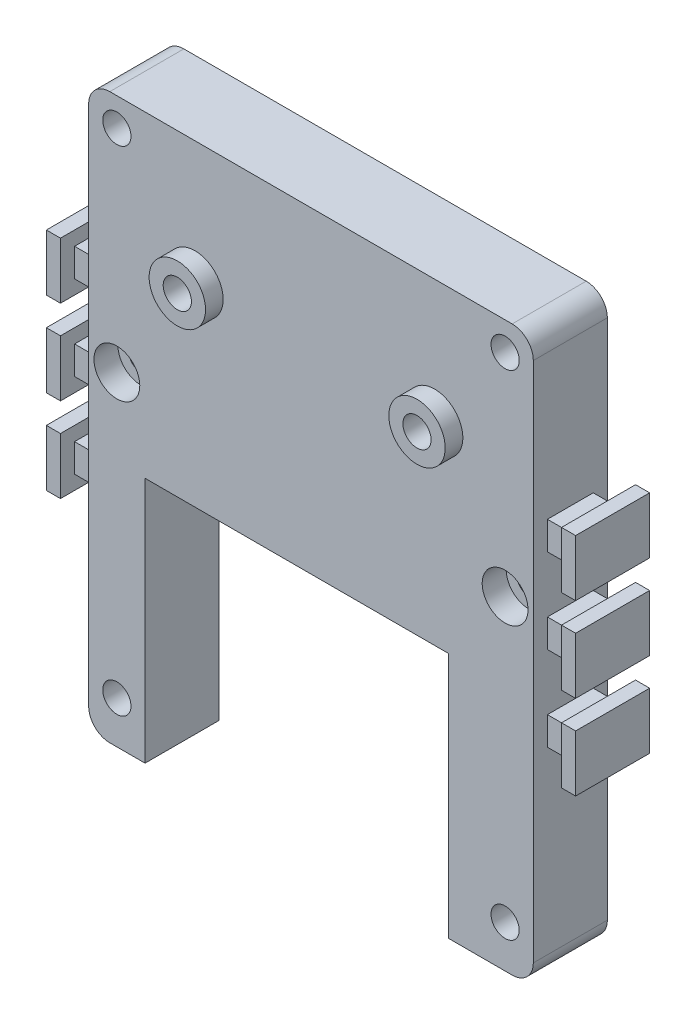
ISO-10303-21;
HEADER;
FILE_DESCRIPTION(('STEP AP214'),'2;1');
FILE_NAME('part.step','',(''),(''),'','','');
FILE_SCHEMA(('AUTOMOTIVE_DESIGN { 1 0 10303 214 1 1 1 1 }'));
ENDSEC;
DATA;
#1=APPLICATION_CONTEXT('core data for automotive mechanical design processes');
#2=APPLICATION_PROTOCOL_DEFINITION('international standard','automotive_design',2000,#1);
#3=PRODUCT_CONTEXT('',#1,'mechanical');
#4=PRODUCT('Part','Part','',(#3));
#5=PRODUCT_RELATED_PRODUCT_CATEGORY('part','',(#4));
#6=PRODUCT_DEFINITION_FORMATION('','',#4);
#7=PRODUCT_DEFINITION_CONTEXT('part definition',#1,'design');
#8=PRODUCT_DEFINITION('design','',#6,#7);
#9=PRODUCT_DEFINITION_SHAPE('','',#8);
#10=(LENGTH_UNIT() NAMED_UNIT(*) SI_UNIT(.MILLI.,.METRE.));
#11=(NAMED_UNIT(*) PLANE_ANGLE_UNIT() SI_UNIT($,.RADIAN.));
#12=(NAMED_UNIT(*) SI_UNIT($,.STERADIAN.) SOLID_ANGLE_UNIT());
#13=UNCERTAINTY_MEASURE_WITH_UNIT(LENGTH_MEASURE(1.E-05),#10,'distance_accuracy_value','');
#14=(GEOMETRIC_REPRESENTATION_CONTEXT(3) GLOBAL_UNCERTAINTY_ASSIGNED_CONTEXT((#13)) GLOBAL_UNIT_ASSIGNED_CONTEXT((#10,
#11,#12)) REPRESENTATION_CONTEXT('',''));
#15=CARTESIAN_POINT('',(0.,0.,0.));
#16=DIRECTION('',(0.,0.,1.));
#17=DIRECTION('',(1.,0.,0.));
#18=AXIS2_PLACEMENT_3D('',#15,#16,#17);
#19=CARTESIAN_POINT('',(0.,0.,10.5));
#20=DIRECTION('',(0.,0.,-1.));
#21=DIRECTION('',(-1.,0.,0.));
#22=AXIS2_PLACEMENT_3D('',#19,#20,#21);
#23=PLANE('',#22);
#24=DIRECTION('',(1.,0.,0.));
#25=VECTOR('',#24,1.);
#26=CARTESIAN_POINT('',(-37.5375,10.5,10.5));
#27=LINE('',#26,#25);
#28=CARTESIAN_POINT('',(-37.5375,10.5,10.5));
#29=VERTEX_POINT('',#28);
#30=CARTESIAN_POINT('',(-35.5375,10.5,10.5));
#31=VERTEX_POINT('',#30);
#32=EDGE_CURVE('E485',#29,#31,#27,.T.);
#33=ORIENTED_EDGE('',*,*,#32,.T.);
#34=DIRECTION('',(0.,1.,0.));
#35=VECTOR('',#34,1.);
#36=CARTESIAN_POINT('',(-35.5375,16.5,10.5));
#37=LINE('',#36,#35);
#38=CARTESIAN_POINT('',(-35.5375,18.5,10.5));
#39=VERTEX_POINT('',#38);
#40=EDGE_CURVE('E462',#31,#39,#37,.T.);
#41=ORIENTED_EDGE('',*,*,#40,.T.);
#42=DIRECTION('',(-1.,0.,0.));
#43=VECTOR('',#42,1.);
#44=CARTESIAN_POINT('',(-35.5375,18.5,10.5));
#45=LINE('',#44,#43);
#46=CARTESIAN_POINT('',(-37.5375,18.5,10.5));
#47=VERTEX_POINT('',#46);
#48=EDGE_CURVE('E492',#39,#47,#45,.T.);
#49=ORIENTED_EDGE('',*,*,#48,.T.);
#50=DIRECTION('',(0.,-1.,0.));
#51=VECTOR('',#50,1.);
#52=CARTESIAN_POINT('',(-37.5375,18.5,10.5));
#53=LINE('',#52,#51);
#54=EDGE_CURVE('E489',#47,#29,#53,.T.);
#55=ORIENTED_EDGE('',*,*,#54,.T.);
#56=EDGE_LOOP('',(#33,#41,#49,#55));
#57=FACE_BOUND('',#56,.T.);
#58=ADVANCED_FACE('F37',(#57),#23,.F.);
#59=DIRECTION('',(1.,0.,0.));
#60=VECTOR('',#59,1.);
#61=CARTESIAN_POINT('',(-37.5375,-1.5,10.5));
#62=LINE('',#61,#60);
#63=CARTESIAN_POINT('',(-37.5375,-1.5,10.5));
#64=VERTEX_POINT('',#63);
#65=CARTESIAN_POINT('',(-35.5375,-1.5,10.5));
#66=VERTEX_POINT('',#65);
#67=EDGE_CURVE('E876',#64,#66,#62,.T.);
#68=ORIENTED_EDGE('',*,*,#67,.T.);
#69=DIRECTION('',(0.,1.,0.));
#70=VECTOR('',#69,1.);
#71=CARTESIAN_POINT('',(-35.5375,4.5,10.5));
#72=LINE('',#71,#70);
#73=CARTESIAN_POINT('',(-35.5375,6.50000000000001,10.5));
#74=VERTEX_POINT('',#73);
#75=EDGE_CURVE('E875',#66,#74,#72,.T.);
#76=ORIENTED_EDGE('',*,*,#75,.T.);
#77=DIRECTION('',(-1.,0.,0.));
#78=VECTOR('',#77,1.);
#79=CARTESIAN_POINT('',(-35.5375,6.50000000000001,10.5));
#80=LINE('',#79,#78);
#81=CARTESIAN_POINT('',(-37.5375,6.5,10.5));
#82=VERTEX_POINT('',#81);
#83=EDGE_CURVE('E883',#74,#82,#80,.T.);
#84=ORIENTED_EDGE('',*,*,#83,.T.);
#85=DIRECTION('',(0.,-1.,0.));
#86=VECTOR('',#85,1.);
#87=CARTESIAN_POINT('',(-37.5375,6.5,10.5));
#88=LINE('',#87,#86);
#89=EDGE_CURVE('E880',#82,#64,#88,.T.);
#90=ORIENTED_EDGE('',*,*,#89,.T.);
#91=EDGE_LOOP('',(#68,#76,#84,#90));
#92=FACE_BOUND('',#91,.T.);
#93=ADVANCED_FACE('F753',(#92),#23,.F.);
#94=DIRECTION('',(1.,0.,0.));
#95=VECTOR('',#94,1.);
#96=CARTESIAN_POINT('',(-37.5375,-13.5,10.5));
#97=LINE('',#96,#95);
#98=CARTESIAN_POINT('',(-37.5375,-13.5,10.5));
#99=VERTEX_POINT('',#98);
#100=CARTESIAN_POINT('',(-35.5375,-13.5,10.5));
#101=VERTEX_POINT('',#100);
#102=EDGE_CURVE('E829',#99,#101,#97,.T.);
#103=ORIENTED_EDGE('',*,*,#102,.T.);
#104=DIRECTION('',(0.,1.,0.));
#105=VECTOR('',#104,1.);
#106=CARTESIAN_POINT('',(-35.5375,-7.5,10.5));
#107=LINE('',#106,#105);
#108=CARTESIAN_POINT('',(-35.5375,-5.49999999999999,10.5));
#109=VERTEX_POINT('',#108);
#110=EDGE_CURVE('E1980',#101,#109,#107,.T.);
#111=ORIENTED_EDGE('',*,*,#110,.T.);
#112=DIRECTION('',(-1.,0.,0.));
#113=VECTOR('',#112,1.);
#114=CARTESIAN_POINT('',(-35.5375,-5.49999999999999,10.5));
#115=LINE('',#114,#113);
#116=CARTESIAN_POINT('',(-37.5375,-5.5,10.5));
#117=VERTEX_POINT('',#116);
#118=EDGE_CURVE('E1986',#109,#117,#115,.T.);
#119=ORIENTED_EDGE('',*,*,#118,.T.);
#120=DIRECTION('',(0.,-1.,0.));
#121=VECTOR('',#120,1.);
#122=CARTESIAN_POINT('',(-37.5375,-5.5,10.5));
#123=LINE('',#122,#121);
#124=EDGE_CURVE('E1983',#117,#99,#123,.T.);
#125=ORIENTED_EDGE('',*,*,#124,.T.);
#126=EDGE_LOOP('',(#103,#111,#119,#125));
#127=FACE_BOUND('',#126,.T.);
#128=ADVANCED_FACE('F758',(#127),#23,.F.);
#129=DIRECTION('',(-1.,0.,0.));
#130=VECTOR('',#129,1.);
#131=CARTESIAN_POINT('',(35.5375,-5.49999999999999,10.5));
#132=LINE('',#131,#130);
#133=CARTESIAN_POINT('',(37.5375,-5.49999999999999,10.5));
#134=VERTEX_POINT('',#133);
#135=CARTESIAN_POINT('',(35.5375,-5.49999999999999,10.5));
#136=VERTEX_POINT('',#135);
#137=EDGE_CURVE('E1936',#134,#136,#132,.T.);
#138=ORIENTED_EDGE('',*,*,#137,.T.);
#139=DIRECTION('',(0.,-1.,0.));
#140=VECTOR('',#139,1.);
#141=CARTESIAN_POINT('',(35.5375,-13.5,10.5));
#142=LINE('',#141,#140);
#143=CARTESIAN_POINT('',(35.5375,-13.5,10.5));
#144=VERTEX_POINT('',#143);
#145=EDGE_CURVE('E1935',#136,#144,#142,.T.);
#146=ORIENTED_EDGE('',*,*,#145,.T.);
#147=DIRECTION('',(1.,0.,0.));
#148=VECTOR('',#147,1.);
#149=CARTESIAN_POINT('',(37.5375,-13.5,10.5));
#150=LINE('',#149,#148);
#151=CARTESIAN_POINT('',(37.5375,-13.5,10.5));
#152=VERTEX_POINT('',#151);
#153=EDGE_CURVE('E1943',#144,#152,#150,.T.);
#154=ORIENTED_EDGE('',*,*,#153,.T.);
#155=DIRECTION('',(0.,1.,0.));
#156=VECTOR('',#155,1.);
#157=CARTESIAN_POINT('',(37.5375,-5.49999999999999,10.5));
#158=LINE('',#157,#156);
#159=EDGE_CURVE('E1940',#152,#134,#158,.T.);
#160=ORIENTED_EDGE('',*,*,#159,.T.);
#161=EDGE_LOOP('',(#138,#146,#154,#160));
#162=FACE_BOUND('',#161,.T.);
#163=ADVANCED_FACE('F1350',(#162),#23,.F.);
#164=DIRECTION('',(-1.,0.,0.));
#165=VECTOR('',#164,1.);
#166=CARTESIAN_POINT('',(35.5375,6.50000000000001,10.5));
#167=LINE('',#166,#165);
#168=CARTESIAN_POINT('',(37.5375,6.50000000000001,10.5));
#169=VERTEX_POINT('',#168);
#170=CARTESIAN_POINT('',(35.5375,6.50000000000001,10.5));
#171=VERTEX_POINT('',#170);
#172=EDGE_CURVE('E831',#169,#171,#167,.T.);
#173=ORIENTED_EDGE('',*,*,#172,.T.);
#174=DIRECTION('',(0.,-1.,0.));
#175=VECTOR('',#174,1.);
#176=CARTESIAN_POINT('',(35.5375,-1.49999999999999,10.5));
#177=LINE('',#176,#175);
#178=CARTESIAN_POINT('',(35.5375,-1.49999999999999,10.5));
#179=VERTEX_POINT('',#178);
#180=EDGE_CURVE('E808',#171,#179,#177,.T.);
#181=ORIENTED_EDGE('',*,*,#180,.T.);
#182=DIRECTION('',(1.,0.,0.));
#183=VECTOR('',#182,1.);
#184=CARTESIAN_POINT('',(37.5375,-1.5,10.5));
#185=LINE('',#184,#183);
#186=CARTESIAN_POINT('',(37.5375,-1.5,10.5));
#187=VERTEX_POINT('',#186);
#188=EDGE_CURVE('E838',#179,#187,#185,.T.);
#189=ORIENTED_EDGE('',*,*,#188,.T.);
#190=DIRECTION('',(0.,1.,0.));
#191=VECTOR('',#190,1.);
#192=CARTESIAN_POINT('',(37.5375,6.50000000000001,10.5));
#193=LINE('',#192,#191);
#194=EDGE_CURVE('E835',#187,#169,#193,.T.);
#195=ORIENTED_EDGE('',*,*,#194,.T.);
#196=EDGE_LOOP('',(#173,#181,#189,#195));
#197=FACE_BOUND('',#196,.T.);
#198=ADVANCED_FACE('F1358',(#197),#23,.F.);
#199=DIRECTION('',(-1.,0.,0.));
#200=VECTOR('',#199,1.);
#201=CARTESIAN_POINT('',(35.5375,18.5,10.5));
#202=LINE('',#201,#200);
#203=CARTESIAN_POINT('',(37.5375,18.5,10.5));
#204=VERTEX_POINT('',#203);
#205=CARTESIAN_POINT('',(35.5375,18.5,10.5));
#206=VERTEX_POINT('',#205);
#207=EDGE_CURVE('E483',#204,#206,#202,.T.);
#208=ORIENTED_EDGE('',*,*,#207,.T.);
#209=DIRECTION('',(0.,-1.,0.));
#210=VECTOR('',#209,1.);
#211=CARTESIAN_POINT('',(35.5375,10.5,10.5));
#212=LINE('',#211,#210);
#213=CARTESIAN_POINT('',(35.5375,10.5,10.5));
#214=VERTEX_POINT('',#213);
#215=EDGE_CURVE('E919',#206,#214,#212,.T.);
#216=ORIENTED_EDGE('',*,*,#215,.T.);
#217=DIRECTION('',(1.,0.,0.));
#218=VECTOR('',#217,1.);
#219=CARTESIAN_POINT('',(37.5375,10.5,10.5));
#220=LINE('',#219,#218);
#221=CARTESIAN_POINT('',(37.5375,10.5,10.5));
#222=VERTEX_POINT('',#221);
#223=EDGE_CURVE('E925',#214,#222,#220,.T.);
#224=ORIENTED_EDGE('',*,*,#223,.T.);
#225=DIRECTION('',(0.,1.,0.));
#226=VECTOR('',#225,1.);
#227=CARTESIAN_POINT('',(37.5375,18.5,10.5));
#228=LINE('',#227,#226);
#229=EDGE_CURVE('E922',#222,#204,#228,.T.);
#230=ORIENTED_EDGE('',*,*,#229,.T.);
#231=EDGE_LOOP('',(#208,#216,#224,#230));
#232=FACE_BOUND('',#231,.T.);
#233=ADVANCED_FACE('F748',(#232),#23,.F.);
#234=CARTESIAN_POINT('',(0.,0.,0.));
#235=DIRECTION('',(0.,0.,-1.));
#236=DIRECTION('',(-1.,0.,0.));
#237=AXIS2_PLACEMENT_3D('',#234,#235,#236);
#238=PLANE('',#237);
#239=DIRECTION('',(0.,1.,0.));
#240=VECTOR('',#239,1.);
#241=CARTESIAN_POINT('',(31.5375,-40.,0.));
#242=LINE('',#241,#240);
#243=CARTESIAN_POINT('',(31.5375,-37.,0.));
#244=VERTEX_POINT('',#243);
#245=CARTESIAN_POINT('',(31.5375,37.,0.));
#246=VERTEX_POINT('',#245);
#247=EDGE_CURVE('E605',#244,#246,#242,.T.);
#248=ORIENTED_EDGE('',*,*,#247,.F.);
#249=CARTESIAN_POINT('',(28.5375,-37.,0.));
#250=DIRECTION('',(0.,0.,-1.));
#251=DIRECTION('',(-1.,0.,0.));
#252=AXIS2_PLACEMENT_3D('',#249,#250,#251);
#253=CIRCLE('',#252,3.);
#254=CARTESIAN_POINT('',(28.5375,-40.,0.));
#255=VERTEX_POINT('',#254);
#256=EDGE_CURVE('E650',#244,#255,#253,.T.);
#257=ORIENTED_EDGE('',*,*,#256,.T.);
#258=DIRECTION('',(1.,0.,0.));
#259=VECTOR('',#258,1.);
#260=CARTESIAN_POINT('',(-31.5375,-40.,0.));
#261=LINE('',#260,#259);
#262=CARTESIAN_POINT('',(19.5375,-40.,0.));
#263=VERTEX_POINT('',#262);
#264=EDGE_CURVE('E633',#263,#255,#261,.T.);
#265=ORIENTED_EDGE('',*,*,#264,.F.);
#266=DIRECTION('',(0.,-1.,0.));
#267=VECTOR('',#266,1.);
#268=CARTESIAN_POINT('',(19.5375,-40.,0.));
#269=LINE('',#268,#267);
#270=CARTESIAN_POINT('',(19.5375,10.,0.));
#271=VERTEX_POINT('',#270);
#272=EDGE_CURVE('E588',#271,#263,#269,.T.);
#273=ORIENTED_EDGE('',*,*,#272,.F.);
#274=CARTESIAN_POINT('',(-1.99999999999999,10.,0.));
#275=DIRECTION('',(0.,0.,-1.));
#276=DIRECTION('',(1.,0.,0.));
#277=AXIS2_PLACEMENT_3D('',#274,#275,#276);
#278=CIRCLE('',#277,21.5375);
#279=CARTESIAN_POINT('',(-23.5375,10.,0.));
#280=VERTEX_POINT('',#279);
#281=EDGE_CURVE('E598',#280,#271,#278,.T.);
#282=ORIENTED_EDGE('',*,*,#281,.F.);
#283=DIRECTION('',(0.,1.,0.));
#284=VECTOR('',#283,1.);
#285=CARTESIAN_POINT('',(-23.5375,10.,0.));
#286=LINE('',#285,#284);
#287=CARTESIAN_POINT('',(-23.5375,-40.,0.));
#288=VERTEX_POINT('',#287);
#289=EDGE_CURVE('E584',#288,#280,#286,.T.);
#290=ORIENTED_EDGE('',*,*,#289,.F.);
#291=CARTESIAN_POINT('',(-28.5375,-40.,0.));
#292=VERTEX_POINT('',#291);
#293=EDGE_CURVE('E617',#292,#288,#261,.T.);
#294=ORIENTED_EDGE('',*,*,#293,.F.);
#295=CARTESIAN_POINT('',(-28.5375,-37.,0.));
#296=DIRECTION('',(0.,0.,-1.));
#297=DIRECTION('',(-1.,0.,0.));
#298=AXIS2_PLACEMENT_3D('',#295,#296,#297);
#299=CIRCLE('',#298,3.);
#300=CARTESIAN_POINT('',(-31.5375,-37.,0.));
#301=VERTEX_POINT('',#300);
#302=EDGE_CURVE('E652',#292,#301,#299,.T.);
#303=ORIENTED_EDGE('',*,*,#302,.T.);
#304=DIRECTION('',(0.,-1.,0.));
#305=VECTOR('',#304,1.);
#306=CARTESIAN_POINT('',(-31.5375,-40.,0.));
#307=LINE('',#306,#305);
#308=CARTESIAN_POINT('',(-31.5375,37.,0.));
#309=VERTEX_POINT('',#308);
#310=EDGE_CURVE('E631',#309,#301,#307,.T.);
#311=ORIENTED_EDGE('',*,*,#310,.F.);
#312=CARTESIAN_POINT('',(-28.5375,37.,0.));
#313=DIRECTION('',(0.,0.,-1.));
#314=DIRECTION('',(-1.,0.,0.));
#315=AXIS2_PLACEMENT_3D('',#312,#313,#314);
#316=CIRCLE('',#315,3.);
#317=CARTESIAN_POINT('',(-28.5375,40.,0.));
#318=VERTEX_POINT('',#317);
#319=EDGE_CURVE('E648',#309,#318,#316,.T.);
#320=ORIENTED_EDGE('',*,*,#319,.T.);
#321=DIRECTION('',(-1.,0.,0.));
#322=VECTOR('',#321,1.);
#323=CARTESIAN_POINT('',(-31.5375,40.,0.));
#324=LINE('',#323,#322);
#325=CARTESIAN_POINT('',(28.5375,40.,0.));
#326=VERTEX_POINT('',#325);
#327=EDGE_CURVE('E628',#326,#318,#324,.T.);
#328=ORIENTED_EDGE('',*,*,#327,.F.);
#329=CARTESIAN_POINT('',(28.5375,37.,0.));
#330=DIRECTION('',(0.,0.,-1.));
#331=DIRECTION('',(-1.,0.,0.));
#332=AXIS2_PLACEMENT_3D('',#329,#330,#331);
#333=CIRCLE('',#332,3.);
#334=EDGE_CURVE('E646',#326,#246,#333,.T.);
#335=ORIENTED_EDGE('',*,*,#334,.T.);
#336=EDGE_LOOP('',(#248,#257,#265,#273,#282,#290,#294,#303,#311,#320,#328,#335));
#337=FACE_BOUND('',#336,.T.);
#338=CARTESIAN_POINT('',(-27.5375,6.00000000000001,0.));
#339=DIRECTION('',(0.,0.,1.));
#340=DIRECTION('',(1.,0.,0.));
#341=AXIS2_PLACEMENT_3D('',#338,#339,#340);
#342=CIRCLE('',#341,1.7);
#343=CARTESIAN_POINT('',(-25.8375,6.00000000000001,0.));
#344=VERTEX_POINT('',#343);
#345=EDGE_CURVE('E1920',#344,#344,#342,.T.);
#346=ORIENTED_EDGE('',*,*,#345,.T.);
#347=EDGE_LOOP('',(#346));
#348=FACE_BOUND('',#347,.T.);
#349=CARTESIAN_POINT('',(27.5375,6.00000000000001,0.));
#350=DIRECTION('',(0.,0.,1.));
#351=DIRECTION('',(1.,0.,0.));
#352=AXIS2_PLACEMENT_3D('',#349,#350,#351);
#353=CIRCLE('',#352,1.7);
#354=CARTESIAN_POINT('',(29.2375,6.00000000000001,0.));
#355=VERTEX_POINT('',#354);
#356=EDGE_CURVE('E1932',#355,#355,#353,.T.);
#357=ORIENTED_EDGE('',*,*,#356,.T.);
#358=EDGE_LOOP('',(#357));
#359=FACE_BOUND('',#358,.T.);
#360=CARTESIAN_POINT('',(27.5375,36.,0.));
#361=DIRECTION('',(0.,0.,-1.));
#362=DIRECTION('',(-1.,0.,0.));
#363=AXIS2_PLACEMENT_3D('',#360,#361,#362);
#364=CIRCLE('',#363,1.99999999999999);
#365=CARTESIAN_POINT('',(25.5375,36.,0.));
#366=VERTEX_POINT('',#365);
#367=EDGE_CURVE('E560',#366,#366,#364,.T.);
#368=ORIENTED_EDGE('',*,*,#367,.F.);
#369=EDGE_LOOP('',(#368));
#370=FACE_BOUND('',#369,.T.);
#371=CARTESIAN_POINT('',(-27.5375,36.,0.));
#372=DIRECTION('',(0.,0.,-1.));
#373=DIRECTION('',(-1.,0.,0.));
#374=AXIS2_PLACEMENT_3D('',#371,#372,#373);
#375=CIRCLE('',#374,1.99999999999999);
#376=CARTESIAN_POINT('',(-29.5375,36.,0.));
#377=VERTEX_POINT('',#376);
#378=EDGE_CURVE('E566',#377,#377,#375,.T.);
#379=ORIENTED_EDGE('',*,*,#378,.F.);
#380=EDGE_LOOP('',(#379));
#381=FACE_BOUND('',#380,.T.);
#382=CARTESIAN_POINT('',(-27.5375,-34.,0.));
#383=DIRECTION('',(0.,0.,-1.));
#384=DIRECTION('',(-1.,0.,0.));
#385=AXIS2_PLACEMENT_3D('',#382,#383,#384);
#386=CIRCLE('',#385,1.99999999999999);
#387=CARTESIAN_POINT('',(-29.5375,-34.,0.));
#388=VERTEX_POINT('',#387);
#389=EDGE_CURVE('E572',#388,#388,#386,.T.);
#390=ORIENTED_EDGE('',*,*,#389,.F.);
#391=EDGE_LOOP('',(#390));
#392=FACE_BOUND('',#391,.T.);
#393=CARTESIAN_POINT('',(27.5375,-34.,0.));
#394=DIRECTION('',(0.,0.,-1.));
#395=DIRECTION('',(-1.,0.,0.));
#396=AXIS2_PLACEMENT_3D('',#393,#394,#395);
#397=CIRCLE('',#396,1.99999999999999);
#398=CARTESIAN_POINT('',(25.5375,-34.,0.));
#399=VERTEX_POINT('',#398);
#400=EDGE_CURVE('E578',#399,#399,#397,.T.);
#401=ORIENTED_EDGE('',*,*,#400,.F.);
#402=EDGE_LOOP('',(#401));
#403=FACE_BOUND('',#402,.T.);
#404=ADVANCED_FACE('F707',(#337,#348,#359,#370,#381,#392,#403),#238,.T.);
#405=DIRECTION('',(0.,-1.,0.));
#406=VECTOR('',#405,1.);
#407=CARTESIAN_POINT('',(35.5375,10.5,0.));
#408=LINE('',#407,#406);
#409=CARTESIAN_POINT('',(35.5375,18.5,0.));
#410=VERTEX_POINT('',#409);
#411=CARTESIAN_POINT('',(35.5375,10.5,0.));
#412=VERTEX_POINT('',#411);
#413=EDGE_CURVE('E467',#410,#412,#408,.T.);
#414=ORIENTED_EDGE('',*,*,#413,.F.);
#415=DIRECTION('',(-1.,0.,0.));
#416=VECTOR('',#415,1.);
#417=CARTESIAN_POINT('',(35.5375,18.5,0.));
#418=LINE('',#417,#416);
#419=CARTESIAN_POINT('',(37.5375,18.5,0.));
#420=VERTEX_POINT('',#419);
#421=EDGE_CURVE('E472',#420,#410,#418,.T.);
#422=ORIENTED_EDGE('',*,*,#421,.F.);
#423=DIRECTION('',(0.,1.,0.));
#424=VECTOR('',#423,1.);
#425=CARTESIAN_POINT('',(37.5375,18.5,0.));
#426=LINE('',#425,#424);
#427=CARTESIAN_POINT('',(37.5375,10.5,0.));
#428=VERTEX_POINT('',#427);
#429=EDGE_CURVE('E475',#428,#420,#426,.T.);
#430=ORIENTED_EDGE('',*,*,#429,.F.);
#431=DIRECTION('',(1.,0.,0.));
#432=VECTOR('',#431,1.);
#433=CARTESIAN_POINT('',(37.5375,10.5,0.));
#434=LINE('',#433,#432);
#435=EDGE_CURVE('E478',#412,#428,#434,.T.);
#436=ORIENTED_EDGE('',*,*,#435,.F.);
#437=EDGE_LOOP('',(#414,#422,#430,#436));
#438=FACE_BOUND('',#437,.T.);
#439=ADVANCED_FACE('F942',(#438),#238,.T.);
#440=DIRECTION('',(0.,-1.,0.));
#441=VECTOR('',#440,1.);
#442=CARTESIAN_POINT('',(35.5375,-1.49999999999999,0.));
#443=LINE('',#442,#441);
#444=CARTESIAN_POINT('',(35.5375,6.50000000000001,0.));
#445=VERTEX_POINT('',#444);
#446=CARTESIAN_POINT('',(35.5375,-1.49999999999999,0.));
#447=VERTEX_POINT('',#446);
#448=EDGE_CURVE('E856',#445,#447,#443,.T.);
#449=ORIENTED_EDGE('',*,*,#448,.F.);
#450=DIRECTION('',(-1.,0.,0.));
#451=VECTOR('',#450,1.);
#452=CARTESIAN_POINT('',(35.5375,6.50000000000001,0.));
#453=LINE('',#452,#451);
#454=CARTESIAN_POINT('',(37.5375,6.50000000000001,0.));
#455=VERTEX_POINT('',#454);
#456=EDGE_CURVE('E843',#455,#445,#453,.T.);
#457=ORIENTED_EDGE('',*,*,#456,.F.);
#458=DIRECTION('',(0.,1.,0.));
#459=VECTOR('',#458,1.);
#460=CARTESIAN_POINT('',(37.5375,6.50000000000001,0.));
#461=LINE('',#460,#459);
#462=CARTESIAN_POINT('',(37.5375,-1.5,0.));
#463=VERTEX_POINT('',#462);
#464=EDGE_CURVE('E848',#463,#455,#461,.T.);
#465=ORIENTED_EDGE('',*,*,#464,.F.);
#466=DIRECTION('',(1.,0.,0.));
#467=VECTOR('',#466,1.);
#468=CARTESIAN_POINT('',(37.5375,-1.5,0.));
#469=LINE('',#468,#467);
#470=EDGE_CURVE('E852',#447,#463,#469,.T.);
#471=ORIENTED_EDGE('',*,*,#470,.F.);
#472=EDGE_LOOP('',(#449,#457,#465,#471));
#473=FACE_BOUND('',#472,.T.);
#474=ADVANCED_FACE('F1389',(#473),#238,.T.);
#475=DIRECTION('',(0.,1.,0.));
#476=VECTOR('',#475,1.);
#477=CARTESIAN_POINT('',(-35.5375,16.5,0.));
#478=LINE('',#477,#476);
#479=CARTESIAN_POINT('',(-35.5375,10.5,0.));
#480=VERTEX_POINT('',#479);
#481=CARTESIAN_POINT('',(-35.5375,18.5,0.));
#482=VERTEX_POINT('',#481);
#483=EDGE_CURVE('E510',#480,#482,#478,.T.);
#484=ORIENTED_EDGE('',*,*,#483,.F.);
#485=DIRECTION('',(1.,0.,0.));
#486=VECTOR('',#485,1.);
#487=CARTESIAN_POINT('',(-37.5375,10.5,0.));
#488=LINE('',#487,#486);
#489=CARTESIAN_POINT('',(-37.5375,10.5,0.));
#490=VERTEX_POINT('',#489);
#491=EDGE_CURVE('E497',#490,#480,#488,.T.);
#492=ORIENTED_EDGE('',*,*,#491,.F.);
#493=DIRECTION('',(0.,-1.,0.));
#494=VECTOR('',#493,1.);
#495=CARTESIAN_POINT('',(-37.5375,18.5,0.));
#496=LINE('',#495,#494);
#497=CARTESIAN_POINT('',(-37.5375,18.5,0.));
#498=VERTEX_POINT('',#497);
#499=EDGE_CURVE('E502',#498,#490,#496,.T.);
#500=ORIENTED_EDGE('',*,*,#499,.F.);
#501=DIRECTION('',(-1.,0.,0.));
#502=VECTOR('',#501,1.);
#503=CARTESIAN_POINT('',(-35.5375,18.5,0.));
#504=LINE('',#503,#502);
#505=EDGE_CURVE('E506',#482,#498,#504,.T.);
#506=ORIENTED_EDGE('',*,*,#505,.F.);
#507=EDGE_LOOP('',(#484,#492,#500,#506));
#508=FACE_BOUND('',#507,.T.);
#509=ADVANCED_FACE('F1399',(#508),#238,.T.);
#510=DIRECTION('',(0.,1.,0.));
#511=VECTOR('',#510,1.);
#512=CARTESIAN_POINT('',(-35.5375,4.5,0.));
#513=LINE('',#512,#511);
#514=CARTESIAN_POINT('',(-35.5375,-1.5,0.));
#515=VERTEX_POINT('',#514);
#516=CARTESIAN_POINT('',(-35.5375,6.50000000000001,0.));
#517=VERTEX_POINT('',#516);
#518=EDGE_CURVE('E901',#515,#517,#513,.T.);
#519=ORIENTED_EDGE('',*,*,#518,.F.);
#520=DIRECTION('',(1.,0.,0.));
#521=VECTOR('',#520,1.);
#522=CARTESIAN_POINT('',(-37.5375,-1.5,0.));
#523=LINE('',#522,#521);
#524=CARTESIAN_POINT('',(-37.5375,-1.5,0.));
#525=VERTEX_POINT('',#524);
#526=EDGE_CURVE('E888',#525,#515,#523,.T.);
#527=ORIENTED_EDGE('',*,*,#526,.F.);
#528=DIRECTION('',(0.,-1.,0.));
#529=VECTOR('',#528,1.);
#530=CARTESIAN_POINT('',(-37.5375,6.5,0.));
#531=LINE('',#530,#529);
#532=CARTESIAN_POINT('',(-37.5375,6.5,0.));
#533=VERTEX_POINT('',#532);
#534=EDGE_CURVE('E893',#533,#525,#531,.T.);
#535=ORIENTED_EDGE('',*,*,#534,.F.);
#536=DIRECTION('',(-1.,0.,0.));
#537=VECTOR('',#536,1.);
#538=CARTESIAN_POINT('',(-35.5375,6.50000000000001,0.));
#539=LINE('',#538,#537);
#540=EDGE_CURVE('E897',#517,#533,#539,.T.);
#541=ORIENTED_EDGE('',*,*,#540,.F.);
#542=EDGE_LOOP('',(#519,#527,#535,#541));
#543=FACE_BOUND('',#542,.T.);
#544=ADVANCED_FACE('F1410',(#543),#238,.T.);
#545=DIRECTION('',(0.,1.,0.));
#546=VECTOR('',#545,1.);
#547=CARTESIAN_POINT('',(-35.5375,-7.5,0.));
#548=LINE('',#547,#546);
#549=CARTESIAN_POINT('',(-35.5375,-13.5,0.));
#550=VERTEX_POINT('',#549);
#551=CARTESIAN_POINT('',(-35.5375,-5.49999999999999,0.));
#552=VERTEX_POINT('',#551);
#553=EDGE_CURVE('E813',#550,#552,#548,.T.);
#554=ORIENTED_EDGE('',*,*,#553,.F.);
#555=DIRECTION('',(1.,0.,0.));
#556=VECTOR('',#555,1.);
#557=CARTESIAN_POINT('',(-37.5375,-13.5,0.));
#558=LINE('',#557,#556);
#559=CARTESIAN_POINT('',(-37.5375,-13.5,0.));
#560=VERTEX_POINT('',#559);
#561=EDGE_CURVE('E818',#560,#550,#558,.T.);
#562=ORIENTED_EDGE('',*,*,#561,.F.);
#563=DIRECTION('',(0.,-1.,0.));
#564=VECTOR('',#563,1.);
#565=CARTESIAN_POINT('',(-37.5375,-5.5,0.));
#566=LINE('',#565,#564);
#567=CARTESIAN_POINT('',(-37.5375,-5.5,0.));
#568=VERTEX_POINT('',#567);
#569=EDGE_CURVE('E821',#568,#560,#566,.T.);
#570=ORIENTED_EDGE('',*,*,#569,.F.);
#571=DIRECTION('',(-1.,0.,0.));
#572=VECTOR('',#571,1.);
#573=CARTESIAN_POINT('',(-35.5375,-5.49999999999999,0.));
#574=LINE('',#573,#572);
#575=EDGE_CURVE('E824',#552,#568,#574,.T.);
#576=ORIENTED_EDGE('',*,*,#575,.F.);
#577=EDGE_LOOP('',(#554,#562,#570,#576));
#578=FACE_BOUND('',#577,.T.);
#579=ADVANCED_FACE('F767',(#578),#238,.T.);
#580=CARTESIAN_POINT('',(-31.5375,-40.,10.5));
#581=DIRECTION('',(0.,1.,0.));
#582=DIRECTION('',(0.,0.,1.));
#583=AXIS2_PLACEMENT_3D('',#580,#581,#582);
#584=PLANE('',#583);
#585=DIRECTION('',(1.,0.,0.));
#586=VECTOR('',#585,1.);
#587=CARTESIAN_POINT('',(-31.5375,-40.,10.5));
#588=LINE('',#587,#586);
#589=CARTESIAN_POINT('',(-28.5375,-40.,10.5));
#590=VERTEX_POINT('',#589);
#591=CARTESIAN_POINT('',(-23.5375,-40.,10.5));
#592=VERTEX_POINT('',#591);
#593=EDGE_CURVE('E623',#590,#592,#588,.T.);
#594=ORIENTED_EDGE('',*,*,#593,.F.);
#595=DIRECTION('',(0.,0.,-1.));
#596=VECTOR('',#595,1.);
#597=CARTESIAN_POINT('',(-28.5375,-40.,10.5));
#598=LINE('',#597,#596);
#599=EDGE_CURVE('E643',#590,#292,#598,.T.);
#600=ORIENTED_EDGE('',*,*,#599,.T.);
#601=ORIENTED_EDGE('',*,*,#293,.T.);
#602=DIRECTION('',(0.,0.,-1.));
#603=VECTOR('',#602,1.);
#604=CARTESIAN_POINT('',(-23.5375,-40.,7.));
#605=LINE('',#604,#603);
#606=EDGE_CURVE('E596',#592,#288,#605,.T.);
#607=ORIENTED_EDGE('',*,*,#606,.F.);
#608=EDGE_LOOP('',(#594,#600,#601,#607));
#609=FACE_BOUND('',#608,.T.);
#610=ADVANCED_FACE('F703',(#609),#584,.F.);
#611=CARTESIAN_POINT('',(-27.5375,6.00000000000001,10.5));
#612=DIRECTION('',(0.,0.,1.));
#613=DIRECTION('',(1.,0.,0.));
#614=AXIS2_PLACEMENT_3D('',#611,#612,#613);
#615=CIRCLE('',#614,3.25);
#616=CARTESIAN_POINT('',(-24.2875,6.00000000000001,10.5));
#617=VERTEX_POINT('',#616);
#618=EDGE_CURVE('E1911',#617,#617,#615,.T.);
#619=ORIENTED_EDGE('',*,*,#618,.F.);
#620=EDGE_LOOP('',(#619));
#621=FACE_BOUND('',#620,.T.);
#622=CARTESIAN_POINT('',(27.5375,6.00000000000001,10.5));
#623=DIRECTION('',(0.,0.,1.));
#624=DIRECTION('',(1.,0.,0.));
#625=AXIS2_PLACEMENT_3D('',#622,#623,#624);
#626=CIRCLE('',#625,3.25);
#627=CARTESIAN_POINT('',(30.7875,6.00000000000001,10.5));
#628=VERTEX_POINT('',#627);
#629=EDGE_CURVE('E1923',#628,#628,#626,.T.);
#630=ORIENTED_EDGE('',*,*,#629,.F.);
#631=EDGE_LOOP('',(#630));
#632=FACE_BOUND('',#631,.T.);
#633=CARTESIAN_POINT('',(-16.4625,22.5,10.5));
#634=DIRECTION('',(0.,0.,-1.));
#635=DIRECTION('',(-1.,0.,0.));
#636=AXIS2_PLACEMENT_3D('',#633,#634,#635);
#637=CIRCLE('',#636,4.);
#638=CARTESIAN_POINT('',(-20.4625,22.5,10.5));
#639=VERTEX_POINT('',#638);
#640=EDGE_CURVE('E625',#639,#639,#637,.F.);
#641=ORIENTED_EDGE('',*,*,#640,.F.);
#642=EDGE_LOOP('',(#641));
#643=FACE_BOUND('',#642,.T.);
#644=CARTESIAN_POINT('',(27.5375,36.,10.5));
#645=DIRECTION('',(0.,0.,-1.));
#646=DIRECTION('',(-1.,0.,0.));
#647=AXIS2_PLACEMENT_3D('',#644,#645,#646);
#648=CIRCLE('',#647,2.);
#649=CARTESIAN_POINT('',(25.5375,36.,10.5));
#650=VERTEX_POINT('',#649);
#651=EDGE_CURVE('E563',#650,#650,#648,.T.);
#652=ORIENTED_EDGE('',*,*,#651,.T.);
#653=EDGE_LOOP('',(#652));
#654=FACE_BOUND('',#653,.T.);
#655=CARTESIAN_POINT('',(-27.5375,36.,10.5));
#656=DIRECTION('',(0.,0.,-1.));
#657=DIRECTION('',(-1.,0.,0.));
#658=AXIS2_PLACEMENT_3D('',#655,#656,#657);
#659=CIRCLE('',#658,2.);
#660=CARTESIAN_POINT('',(-29.5375,36.,10.5));
#661=VERTEX_POINT('',#660);
#662=EDGE_CURVE('E569',#661,#661,#659,.T.);
#663=ORIENTED_EDGE('',*,*,#662,.T.);
#664=EDGE_LOOP('',(#663));
#665=FACE_BOUND('',#664,.T.);
#666=CARTESIAN_POINT('',(-27.5375,-34.,10.5));
#667=DIRECTION('',(0.,0.,-1.));
#668=DIRECTION('',(-1.,0.,0.));
#669=AXIS2_PLACEMENT_3D('',#666,#667,#668);
#670=CIRCLE('',#669,2.);
#671=CARTESIAN_POINT('',(-29.5375,-34.,10.5));
#672=VERTEX_POINT('',#671);
#673=EDGE_CURVE('E575',#672,#672,#670,.T.);
#674=ORIENTED_EDGE('',*,*,#673,.T.);
#675=EDGE_LOOP('',(#674));
#676=FACE_BOUND('',#675,.T.);
#677=CARTESIAN_POINT('',(27.5375,-34.,10.5));
#678=DIRECTION('',(0.,0.,-1.));
#679=DIRECTION('',(-1.,0.,0.));
#680=AXIS2_PLACEMENT_3D('',#677,#678,#679);
#681=CIRCLE('',#680,2.);
#682=CARTESIAN_POINT('',(25.5375,-34.,10.5));
#683=VERTEX_POINT('',#682);
#684=EDGE_CURVE('E581',#683,#683,#681,.T.);
#685=ORIENTED_EDGE('',*,*,#684,.T.);
#686=EDGE_LOOP('',(#685));
#687=FACE_BOUND('',#686,.T.);
#688=CARTESIAN_POINT('',(-28.5375,37.,10.5));
#689=DIRECTION('',(0.,0.,-1.));
#690=DIRECTION('',(-1.,0.,0.));
#691=AXIS2_PLACEMENT_3D('',#688,#689,#690);
#692=CIRCLE('',#691,3.);
#693=CARTESIAN_POINT('',(-28.5375,40.,10.5));
#694=VERTEX_POINT('',#693);
#695=CARTESIAN_POINT('',(-31.5375,37.,10.5));
#696=VERTEX_POINT('',#695);
#697=EDGE_CURVE('E660',#694,#696,#692,.F.);
#698=ORIENTED_EDGE('',*,*,#697,.T.);
#699=DIRECTION('',(0.,-1.,0.));
#700=VECTOR('',#699,1.);
#701=CARTESIAN_POINT('',(-31.5375,-40.,10.5));
#702=LINE('',#701,#700);
#703=CARTESIAN_POINT('',(-31.5375,-37.,10.5));
#704=VERTEX_POINT('',#703);
#705=EDGE_CURVE('E620',#696,#704,#702,.T.);
#706=ORIENTED_EDGE('',*,*,#705,.T.);
#707=CARTESIAN_POINT('',(-28.5375,-37.,10.5));
#708=DIRECTION('',(0.,0.,-1.));
#709=DIRECTION('',(-1.,0.,0.));
#710=AXIS2_PLACEMENT_3D('',#707,#708,#709);
#711=CIRCLE('',#710,3.);
#712=EDGE_CURVE('E666',#704,#590,#711,.F.);
#713=ORIENTED_EDGE('',*,*,#712,.T.);
#714=ORIENTED_EDGE('',*,*,#593,.T.);
#715=DIRECTION('',(0.,-1.,0.));
#716=VECTOR('',#715,1.);
#717=CARTESIAN_POINT('',(-23.5375,-40.,10.5));
#718=LINE('',#717,#716);
#719=CARTESIAN_POINT('',(-23.5375,-5.,10.5));
#720=VERTEX_POINT('',#719);
#721=EDGE_CURVE('E528',#720,#592,#718,.T.);
#722=ORIENTED_EDGE('',*,*,#721,.F.);
#723=DIRECTION('',(-1.,0.,0.));
#724=VECTOR('',#723,1.);
#725=CARTESIAN_POINT('',(-23.5375,-5.,10.5));
#726=LINE('',#725,#724);
#727=CARTESIAN_POINT('',(19.5375,-5.,10.5));
#728=VERTEX_POINT('',#727);
#729=EDGE_CURVE('E534',#728,#720,#726,.T.);
#730=ORIENTED_EDGE('',*,*,#729,.F.);
#731=DIRECTION('',(0.,1.,0.));
#732=VECTOR('',#731,1.);
#733=CARTESIAN_POINT('',(19.5375,-40.,10.5));
#734=LINE('',#733,#732);
#735=CARTESIAN_POINT('',(19.5375,-40.,10.5));
#736=VERTEX_POINT('',#735);
#737=EDGE_CURVE('E531',#736,#728,#734,.T.);
#738=ORIENTED_EDGE('',*,*,#737,.F.);
#739=CARTESIAN_POINT('',(28.5375,-40.,10.5));
#740=VERTEX_POINT('',#739);
#741=EDGE_CURVE('E622',#736,#740,#588,.T.);
#742=ORIENTED_EDGE('',*,*,#741,.T.);
#743=CARTESIAN_POINT('',(28.5375,-37.,10.5));
#744=DIRECTION('',(0.,0.,-1.));
#745=DIRECTION('',(-1.,0.,0.));
#746=AXIS2_PLACEMENT_3D('',#743,#744,#745);
#747=CIRCLE('',#746,3.);
#748=CARTESIAN_POINT('',(31.5375,-37.,10.5));
#749=VERTEX_POINT('',#748);
#750=EDGE_CURVE('E663',#740,#749,#747,.F.);
#751=ORIENTED_EDGE('',*,*,#750,.T.);
#752=DIRECTION('',(0.,1.,0.));
#753=VECTOR('',#752,1.);
#754=CARTESIAN_POINT('',(31.5375,-40.,10.5));
#755=LINE('',#754,#753);
#756=CARTESIAN_POINT('',(31.5375,37.,10.5));
#757=VERTEX_POINT('',#756);
#758=EDGE_CURVE('E613',#749,#757,#755,.T.);
#759=ORIENTED_EDGE('',*,*,#758,.T.);
#760=CARTESIAN_POINT('',(28.5375,37.,10.5));
#761=DIRECTION('',(0.,0.,-1.));
#762=DIRECTION('',(-1.,0.,0.));
#763=AXIS2_PLACEMENT_3D('',#760,#761,#762);
#764=CIRCLE('',#763,3.);
#765=CARTESIAN_POINT('',(28.5375,40.,10.5));
#766=VERTEX_POINT('',#765);
#767=EDGE_CURVE('E658',#757,#766,#764,.F.);
#768=ORIENTED_EDGE('',*,*,#767,.T.);
#769=DIRECTION('',(-1.,0.,0.));
#770=VECTOR('',#769,1.);
#771=CARTESIAN_POINT('',(-31.5375,40.,10.5));
#772=LINE('',#771,#770);
#773=EDGE_CURVE('E616',#766,#694,#772,.T.);
#774=ORIENTED_EDGE('',*,*,#773,.T.);
#775=EDGE_LOOP('',(#698,#706,#713,#714,#722,#730,#738,#742,#751,#759,#768,#774));
#776=FACE_BOUND('',#775,.T.);
#777=CARTESIAN_POINT('',(17.5375,22.5,10.5));
#778=DIRECTION('',(0.,0.,-1.));
#779=DIRECTION('',(-1.,0.,0.));
#780=AXIS2_PLACEMENT_3D('',#777,#778,#779);
#781=CIRCLE('',#780,4.);
#782=CARTESIAN_POINT('',(13.5375,22.5,10.5));
#783=VERTEX_POINT('',#782);
#784=EDGE_CURVE('E637',#783,#783,#781,.F.);
#785=ORIENTED_EDGE('',*,*,#784,.F.);
#786=EDGE_LOOP('',(#785));
#787=FACE_BOUND('',#786,.T.);
#788=ADVANCED_FACE('F688',(#621,#632,#643,#654,#665,#676,#687,#776,#787),#23,.F.);
#789=CARTESIAN_POINT('',(31.5375,-40.,10.5));
#790=DIRECTION('',(-1.,0.,0.));
#791=DIRECTION('',(0.,0.,1.));
#792=AXIS2_PLACEMENT_3D('',#789,#790,#791);
#793=PLANE('',#792);
#794=DIRECTION('',(0.,1.,0.));
#795=VECTOR('',#794,1.);
#796=CARTESIAN_POINT('',(31.5375,-40.,2.));
#797=LINE('',#796,#795);
#798=CARTESIAN_POINT('',(31.5375,-11.5,2.));
#799=VERTEX_POINT('',#798);
#800=CARTESIAN_POINT('',(31.5375,-7.49999999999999,2.));
#801=VERTEX_POINT('',#800);
#802=EDGE_CURVE('E2021',#799,#801,#797,.T.);
#803=ORIENTED_EDGE('',*,*,#802,.F.);
#804=DIRECTION('',(0.,0.,1.));
#805=VECTOR('',#804,1.);
#806=CARTESIAN_POINT('',(31.5375,-11.5,-10.));
#807=LINE('',#806,#805);
#808=CARTESIAN_POINT('',(31.5375,-11.5,8.5));
#809=VERTEX_POINT('',#808);
#810=EDGE_CURVE('E1967',#799,#809,#807,.T.);
#811=ORIENTED_EDGE('',*,*,#810,.T.);
#812=DIRECTION('',(0.,1.,0.));
#813=VECTOR('',#812,1.);
#814=CARTESIAN_POINT('',(31.5375,-40.,8.5));
#815=LINE('',#814,#813);
#816=CARTESIAN_POINT('',(31.5375,-7.49999999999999,8.5));
#817=VERTEX_POINT('',#816);
#818=EDGE_CURVE('E446',#809,#817,#815,.T.);
#819=ORIENTED_EDGE('',*,*,#818,.T.);
#820=DIRECTION('',(0.,0.,1.));
#821=VECTOR('',#820,1.);
#822=CARTESIAN_POINT('',(31.5375,-7.49999999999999,-10.));
#823=LINE('',#822,#821);
#824=EDGE_CURVE('E1964',#801,#817,#823,.T.);
#825=ORIENTED_EDGE('',*,*,#824,.F.);
#826=EDGE_LOOP('',(#803,#811,#819,#825));
#827=FACE_BOUND('',#826,.T.);
#828=CARTESIAN_POINT('',(31.5375,0.5,2.));
#829=VERTEX_POINT('',#828);
#830=CARTESIAN_POINT('',(31.5375,4.50000000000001,2.));
#831=VERTEX_POINT('',#830);
#832=EDGE_CURVE('E2023',#829,#831,#797,.T.);
#833=ORIENTED_EDGE('',*,*,#832,.F.);
#834=DIRECTION('',(0.,0.,1.));
#835=VECTOR('',#834,1.);
#836=CARTESIAN_POINT('',(31.5375,0.500000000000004,-10.));
#837=LINE('',#836,#835);
#838=CARTESIAN_POINT('',(31.5375,0.5,8.5));
#839=VERTEX_POINT('',#838);
#840=EDGE_CURVE('E862',#829,#839,#837,.T.);
#841=ORIENTED_EDGE('',*,*,#840,.T.);
#842=CARTESIAN_POINT('',(31.5375,4.50000000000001,8.5));
#843=VERTEX_POINT('',#842);
#844=EDGE_CURVE('E443',#839,#843,#815,.T.);
#845=ORIENTED_EDGE('',*,*,#844,.T.);
#846=DIRECTION('',(0.,0.,1.));
#847=VECTOR('',#846,1.);
#848=CARTESIAN_POINT('',(31.5375,4.50000000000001,-10.));
#849=LINE('',#848,#847);
#850=EDGE_CURVE('E859',#831,#843,#849,.T.);
#851=ORIENTED_EDGE('',*,*,#850,.F.);
#852=EDGE_LOOP('',(#833,#841,#845,#851));
#853=FACE_BOUND('',#852,.T.);
#854=CARTESIAN_POINT('',(31.5375,12.5,2.));
#855=VERTEX_POINT('',#854);
#856=CARTESIAN_POINT('',(31.5375,16.5,2.));
#857=VERTEX_POINT('',#856);
#858=EDGE_CURVE('E2018',#855,#857,#797,.T.);
#859=ORIENTED_EDGE('',*,*,#858,.F.);
#860=DIRECTION('',(0.,0.,1.));
#861=VECTOR('',#860,1.);
#862=CARTESIAN_POINT('',(31.5375,12.5,-10.));
#863=LINE('',#862,#861);
#864=CARTESIAN_POINT('',(31.5375,12.5,8.5));
#865=VERTEX_POINT('',#864);
#866=EDGE_CURVE('E440',#855,#865,#863,.T.);
#867=ORIENTED_EDGE('',*,*,#866,.T.);
#868=CARTESIAN_POINT('',(31.5375,16.5,8.5));
#869=VERTEX_POINT('',#868);
#870=EDGE_CURVE('E432',#865,#869,#815,.T.);
#871=ORIENTED_EDGE('',*,*,#870,.T.);
#872=DIRECTION('',(0.,0.,1.));
#873=VECTOR('',#872,1.);
#874=CARTESIAN_POINT('',(31.5375,16.5,-10.));
#875=LINE('',#874,#873);
#876=EDGE_CURVE('E438',#857,#869,#875,.T.);
#877=ORIENTED_EDGE('',*,*,#876,.F.);
#878=EDGE_LOOP('',(#859,#867,#871,#877));
#879=FACE_BOUND('',#878,.T.);
#880=DIRECTION('',(0.,0.,-1.));
#881=VECTOR('',#880,1.);
#882=CARTESIAN_POINT('',(31.5375,-37.,10.5));
#883=LINE('',#882,#881);
#884=EDGE_CURVE('E668',#749,#244,#883,.T.);
#885=ORIENTED_EDGE('',*,*,#884,.T.);
#886=ORIENTED_EDGE('',*,*,#247,.T.);
#887=DIRECTION('',(0.,0.,-1.));
#888=VECTOR('',#887,1.);
#889=CARTESIAN_POINT('',(31.5375,37.,10.5));
#890=LINE('',#889,#888);
#891=EDGE_CURVE('E11',#246,#757,#890,.F.);
#892=ORIENTED_EDGE('',*,*,#891,.T.);
#893=ORIENTED_EDGE('',*,*,#758,.F.);
#894=EDGE_LOOP('',(#885,#886,#892,#893));
#895=FACE_BOUND('',#894,.T.);
#896=ADVANCED_FACE('F435',(#827,#853,#879,#895),#793,.F.);
#897=CARTESIAN_POINT('',(-31.5375,40.,10.5));
#898=DIRECTION('',(0.,-1.,0.));
#899=DIRECTION('',(0.,0.,-1.));
#900=AXIS2_PLACEMENT_3D('',#897,#898,#899);
#901=PLANE('',#900);
#902=ORIENTED_EDGE('',*,*,#327,.T.);
#903=DIRECTION('',(0.,0.,-1.));
#904=VECTOR('',#903,1.);
#905=CARTESIAN_POINT('',(-28.5375,40.,10.5));
#906=LINE('',#905,#904);
#907=EDGE_CURVE('E45',#318,#694,#906,.F.);
#908=ORIENTED_EDGE('',*,*,#907,.T.);
#909=ORIENTED_EDGE('',*,*,#773,.F.);
#910=DIRECTION('',(0.,0.,-1.));
#911=VECTOR('',#910,1.);
#912=CARTESIAN_POINT('',(28.5375,40.,10.5));
#913=LINE('',#912,#911);
#914=EDGE_CURVE('E676',#766,#326,#913,.T.);
#915=ORIENTED_EDGE('',*,*,#914,.T.);
#916=EDGE_LOOP('',(#902,#908,#909,#915));
#917=FACE_BOUND('',#916,.T.);
#918=ADVANCED_FACE('F681',(#917),#901,.F.);
#919=CARTESIAN_POINT('',(-31.5375,-40.,10.5));
#920=DIRECTION('',(1.,0.,0.));
#921=DIRECTION('',(0.,0.,-1.));
#922=AXIS2_PLACEMENT_3D('',#919,#920,#921);
#923=PLANE('',#922);
#924=DIRECTION('',(0.,1.,0.));
#925=VECTOR('',#924,1.);
#926=CARTESIAN_POINT('',(-31.5375,-40.0000000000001,8.50000000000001));
#927=LINE('',#926,#925);
#928=CARTESIAN_POINT('',(-31.5375,0.500000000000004,8.50000000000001));
#929=VERTEX_POINT('',#928);
#930=CARTESIAN_POINT('',(-31.5375,4.5,8.50000000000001));
#931=VERTEX_POINT('',#930);
#932=EDGE_CURVE('E776',#929,#931,#927,.T.);
#933=ORIENTED_EDGE('',*,*,#932,.F.);
#934=DIRECTION('',(0.,0.,1.));
#935=VECTOR('',#934,1.);
#936=CARTESIAN_POINT('',(-31.5375,0.500000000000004,-10.));
#937=LINE('',#936,#935);
#938=CARTESIAN_POINT('',(-31.5375,0.500000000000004,2.));
#939=VERTEX_POINT('',#938);
#940=EDGE_CURVE('E904',#939,#929,#937,.T.);
#941=ORIENTED_EDGE('',*,*,#940,.F.);
#942=DIRECTION('',(0.,1.,0.));
#943=VECTOR('',#942,1.);
#944=CARTESIAN_POINT('',(-31.5375,-40.0000000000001,2.));
#945=LINE('',#944,#943);
#946=CARTESIAN_POINT('',(-31.5375,4.5,2.));
#947=VERTEX_POINT('',#946);
#948=EDGE_CURVE('E1868',#939,#947,#945,.T.);
#949=ORIENTED_EDGE('',*,*,#948,.T.);
#950=DIRECTION('',(0.,0.,1.));
#951=VECTOR('',#950,1.);
#952=CARTESIAN_POINT('',(-31.5375,4.5,-10.));
#953=LINE('',#952,#951);
#954=EDGE_CURVE('E907',#947,#931,#953,.T.);
#955=ORIENTED_EDGE('',*,*,#954,.T.);
#956=EDGE_LOOP('',(#933,#941,#949,#955));
#957=FACE_BOUND('',#956,.T.);
#958=CARTESIAN_POINT('',(-31.5375,12.5,8.50000000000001));
#959=VERTEX_POINT('',#958);
#960=CARTESIAN_POINT('',(-31.5375,16.5,8.50000000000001));
#961=VERTEX_POINT('',#960);
#962=EDGE_CURVE('E52',#959,#961,#927,.T.);
#963=ORIENTED_EDGE('',*,*,#962,.F.);
#964=DIRECTION('',(0.,0.,1.));
#965=VECTOR('',#964,1.);
#966=CARTESIAN_POINT('',(-31.5375,12.5,-10.));
#967=LINE('',#966,#965);
#968=CARTESIAN_POINT('',(-31.5375,12.5,2.));
#969=VERTEX_POINT('',#968);
#970=EDGE_CURVE('E513',#969,#959,#967,.T.);
#971=ORIENTED_EDGE('',*,*,#970,.F.);
#972=CARTESIAN_POINT('',(-31.5375,16.5,2.));
#973=VERTEX_POINT('',#972);
#974=EDGE_CURVE('E60',#969,#973,#945,.T.);
#975=ORIENTED_EDGE('',*,*,#974,.T.);
#976=DIRECTION('',(0.,0.,1.));
#977=VECTOR('',#976,1.);
#978=CARTESIAN_POINT('',(-31.5375,16.5,-10.));
#979=LINE('',#978,#977);
#980=EDGE_CURVE('E516',#973,#961,#979,.T.);
#981=ORIENTED_EDGE('',*,*,#980,.T.);
#982=EDGE_LOOP('',(#963,#971,#975,#981));
#983=FACE_BOUND('',#982,.T.);
#984=CARTESIAN_POINT('',(-31.5375,-11.5,8.50000000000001));
#985=VERTEX_POINT('',#984);
#986=CARTESIAN_POINT('',(-31.5375,-7.5,8.50000000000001));
#987=VERTEX_POINT('',#986);
#988=EDGE_CURVE('E781',#985,#987,#927,.T.);
#989=ORIENTED_EDGE('',*,*,#988,.F.);
#990=DIRECTION('',(0.,0.,1.));
#991=VECTOR('',#990,1.);
#992=CARTESIAN_POINT('',(-31.5375,-11.5,-10.));
#993=LINE('',#992,#991);
#994=CARTESIAN_POINT('',(-31.5375,-11.5,2.));
#995=VERTEX_POINT('',#994);
#996=EDGE_CURVE('E785',#995,#985,#993,.T.);
#997=ORIENTED_EDGE('',*,*,#996,.F.);
#998=CARTESIAN_POINT('',(-31.5375,-7.5,2.));
#999=VERTEX_POINT('',#998);
#1000=EDGE_CURVE('E1870',#995,#999,#945,.T.);
#1001=ORIENTED_EDGE('',*,*,#1000,.T.);
#1002=DIRECTION('',(0.,0.,1.));
#1003=VECTOR('',#1002,1.);
#1004=CARTESIAN_POINT('',(-31.5375,-7.5,-10.));
#1005=LINE('',#1004,#1003);
#1006=EDGE_CURVE('E787',#999,#987,#1005,.T.);
#1007=ORIENTED_EDGE('',*,*,#1006,.T.);
#1008=EDGE_LOOP('',(#989,#997,#1001,#1007));
#1009=FACE_BOUND('',#1008,.T.);
#1010=ORIENTED_EDGE('',*,*,#705,.F.);
#1011=DIRECTION('',(0.,0.,-1.));
#1012=VECTOR('',#1011,1.);
#1013=CARTESIAN_POINT('',(-31.5375,37.,10.5));
#1014=LINE('',#1013,#1012);
#1015=EDGE_CURVE('E673',#696,#309,#1014,.T.);
#1016=ORIENTED_EDGE('',*,*,#1015,.T.);
#1017=ORIENTED_EDGE('',*,*,#310,.T.);
#1018=DIRECTION('',(0.,0.,-1.));
#1019=VECTOR('',#1018,1.);
#1020=CARTESIAN_POINT('',(-31.5375,-37.,10.5));
#1021=LINE('',#1020,#1019);
#1022=EDGE_CURVE('E655',#301,#704,#1021,.F.);
#1023=ORIENTED_EDGE('',*,*,#1022,.T.);
#1024=EDGE_LOOP('',(#1010,#1016,#1017,#1023));
#1025=FACE_BOUND('',#1024,.T.);
#1026=ADVANCED_FACE('F694',(#957,#983,#1009,#1025),#923,.F.);
#1027=ORIENTED_EDGE('',*,*,#264,.T.);
#1028=DIRECTION('',(0.,0.,-1.));
#1029=VECTOR('',#1028,1.);
#1030=CARTESIAN_POINT('',(28.5375,-40.,10.5));
#1031=LINE('',#1030,#1029);
#1032=EDGE_CURVE('E671',#255,#740,#1031,.F.);
#1033=ORIENTED_EDGE('',*,*,#1032,.T.);
#1034=ORIENTED_EDGE('',*,*,#741,.F.);
#1035=DIRECTION('',(0.,0.,-1.));
#1036=VECTOR('',#1035,1.);
#1037=CARTESIAN_POINT('',(19.5375,-40.,7.));
#1038=LINE('',#1037,#1036);
#1039=EDGE_CURVE('E602',#736,#263,#1038,.T.);
#1040=ORIENTED_EDGE('',*,*,#1039,.T.);
#1041=EDGE_LOOP('',(#1027,#1033,#1034,#1040));
#1042=FACE_BOUND('',#1041,.T.);
#1043=ADVANCED_FACE('F729',(#1042),#584,.F.);
#1044=DIRECTION('',(0.,-1.,0.));
#1045=VECTOR('',#1044,1.);
#1046=CARTESIAN_POINT('',(35.5375,-13.5,0.));
#1047=LINE('',#1046,#1045);
#1048=CARTESIAN_POINT('',(35.5375,-5.49999999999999,0.));
#1049=VERTEX_POINT('',#1048);
#1050=CARTESIAN_POINT('',(35.5375,-13.5,0.));
#1051=VERTEX_POINT('',#1050);
#1052=EDGE_CURVE('E1961',#1049,#1051,#1047,.T.);
#1053=ORIENTED_EDGE('',*,*,#1052,.F.);
#1054=DIRECTION('',(-1.,0.,0.));
#1055=VECTOR('',#1054,1.);
#1056=CARTESIAN_POINT('',(35.5375,-5.49999999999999,0.));
#1057=LINE('',#1056,#1055);
#1058=CARTESIAN_POINT('',(37.5375,-5.49999999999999,0.));
#1059=VERTEX_POINT('',#1058);
#1060=EDGE_CURVE('E1948',#1059,#1049,#1057,.T.);
#1061=ORIENTED_EDGE('',*,*,#1060,.F.);
#1062=DIRECTION('',(0.,1.,0.));
#1063=VECTOR('',#1062,1.);
#1064=CARTESIAN_POINT('',(37.5375,-5.49999999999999,0.));
#1065=LINE('',#1064,#1063);
#1066=CARTESIAN_POINT('',(37.5375,-13.5,0.));
#1067=VERTEX_POINT('',#1066);
#1068=EDGE_CURVE('E1953',#1067,#1059,#1065,.T.);
#1069=ORIENTED_EDGE('',*,*,#1068,.F.);
#1070=DIRECTION('',(1.,0.,0.));
#1071=VECTOR('',#1070,1.);
#1072=CARTESIAN_POINT('',(37.5375,-13.5,0.));
#1073=LINE('',#1072,#1071);
#1074=EDGE_CURVE('E1957',#1051,#1067,#1073,.T.);
#1075=ORIENTED_EDGE('',*,*,#1074,.F.);
#1076=EDGE_LOOP('',(#1053,#1061,#1069,#1075));
#1077=FACE_BOUND('',#1076,.T.);
#1078=ADVANCED_FACE('F763',(#1077),#238,.T.);
#1079=CARTESIAN_POINT('',(19.5375,-40.,7.));
#1080=DIRECTION('',(1.,0.,0.));
#1081=DIRECTION('',(0.,1.,0.));
#1082=AXIS2_PLACEMENT_3D('',#1079,#1080,#1081);
#1083=PLANE('',#1082);
#1084=ORIENTED_EDGE('',*,*,#272,.T.);
#1085=ORIENTED_EDGE('',*,*,#1039,.F.);
#1086=ORIENTED_EDGE('',*,*,#737,.T.);
#1087=DIRECTION('',(0.,0.,1.));
#1088=VECTOR('',#1087,1.);
#1089=CARTESIAN_POINT('',(19.5375,-5.,0.));
#1090=LINE('',#1089,#1088);
#1091=CARTESIAN_POINT('',(19.5375,-5.,7.));
#1092=VERTEX_POINT('',#1091);
#1093=EDGE_CURVE('E537',#1092,#728,#1090,.T.);
#1094=ORIENTED_EDGE('',*,*,#1093,.F.);
#1095=DIRECTION('',(0.,-1.,0.));
#1096=VECTOR('',#1095,1.);
#1097=CARTESIAN_POINT('',(19.5375,-40.,7.));
#1098=LINE('',#1097,#1096);
#1099=CARTESIAN_POINT('',(19.5375,10.,7.));
#1100=VERTEX_POINT('',#1099);
#1101=EDGE_CURVE('E592',#1100,#1092,#1098,.T.);
#1102=ORIENTED_EDGE('',*,*,#1101,.F.);
#1103=DIRECTION('',(0.,0.,-1.));
#1104=VECTOR('',#1103,1.);
#1105=CARTESIAN_POINT('',(19.5375,10.,7.));
#1106=LINE('',#1105,#1104);
#1107=EDGE_CURVE('E606',#1100,#271,#1106,.T.);
#1108=ORIENTED_EDGE('',*,*,#1107,.T.);
#1109=EDGE_LOOP('',(#1084,#1085,#1086,#1094,#1102,#1108));
#1110=FACE_BOUND('',#1109,.T.);
#1111=ADVANCED_FACE('F724',(#1110),#1083,.F.);
#1112=CARTESIAN_POINT('',(-1.99999999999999,10.,7.));
#1113=DIRECTION('',(0.,0.,-1.));
#1114=DIRECTION('',(-1.,0.,0.));
#1115=AXIS2_PLACEMENT_3D('',#1112,#1113,#1114);
#1116=CYLINDRICAL_SURFACE('',#1115,21.5375);
#1117=ORIENTED_EDGE('',*,*,#281,.T.);
#1118=ORIENTED_EDGE('',*,*,#1107,.F.);
#1119=CARTESIAN_POINT('',(-1.99999999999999,10.,7.));
#1120=DIRECTION('',(0.,0.,-1.));
#1121=DIRECTION('',(1.,0.,0.));
#1122=AXIS2_PLACEMENT_3D('',#1119,#1120,#1121);
#1123=CIRCLE('',#1122,21.5375);
#1124=CARTESIAN_POINT('',(16.7011028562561,20.6832887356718,7.));
#1125=VERTEX_POINT('',#1124);
#1126=EDGE_CURVE('E587',#1125,#1100,#1123,.T.);
#1127=ORIENTED_EDGE('',*,*,#1126,.F.);
#1128=CARTESIAN_POINT('',(15.5375009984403,22.5019984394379,7.));
#1129=VERTEX_POINT('',#1128);
#1130=EDGE_CURVE('E593',#1129,#1125,#1123,.T.);
#1131=ORIENTED_EDGE('',*,*,#1130,.F.);
#1132=CARTESIAN_POINT('',(-23.5375,10.,7.));
#1133=VERTEX_POINT('',#1132);
#1134=EDGE_CURVE('E589',#1133,#1129,#1123,.T.);
#1135=ORIENTED_EDGE('',*,*,#1134,.F.);
#1136=DIRECTION('',(0.,0.,-1.));
#1137=VECTOR('',#1136,1.);
#1138=CARTESIAN_POINT('',(-23.5375,10.,7.));
#1139=LINE('',#1138,#1137);
#1140=EDGE_CURVE('E608',#1133,#280,#1139,.T.);
#1141=ORIENTED_EDGE('',*,*,#1140,.T.);
#1142=EDGE_LOOP('',(#1117,#1118,#1127,#1131,#1135,#1141));
#1143=FACE_BOUND('',#1142,.T.);
#1144=ADVANCED_FACE('F1048',(#1143),#1116,.F.);
#1145=CARTESIAN_POINT('',(-23.5375,10.,7.));
#1146=DIRECTION('',(-1.,0.,0.));
#1147=DIRECTION('',(0.,-1.,0.));
#1148=AXIS2_PLACEMENT_3D('',#1145,#1146,#1147);
#1149=PLANE('',#1148);
#1150=DIRECTION('',(0.,1.,0.));
#1151=VECTOR('',#1150,1.);
#1152=CARTESIAN_POINT('',(-23.5375,10.,7.));
#1153=LINE('',#1152,#1151);
#1154=CARTESIAN_POINT('',(-23.5375,-5.,7.));
#1155=VERTEX_POINT('',#1154);
#1156=EDGE_CURVE('E585',#1155,#1133,#1153,.T.);
#1157=ORIENTED_EDGE('',*,*,#1156,.F.);
#1158=DIRECTION('',(0.,0.,1.));
#1159=VECTOR('',#1158,1.);
#1160=CARTESIAN_POINT('',(-23.5375,-5.,0.));
#1161=LINE('',#1160,#1159);
#1162=EDGE_CURVE('E538',#1155,#720,#1161,.T.);
#1163=ORIENTED_EDGE('',*,*,#1162,.T.);
#1164=ORIENTED_EDGE('',*,*,#721,.T.);
#1165=ORIENTED_EDGE('',*,*,#606,.T.);
#1166=ORIENTED_EDGE('',*,*,#289,.T.);
#1167=ORIENTED_EDGE('',*,*,#1140,.F.);
#1168=EDGE_LOOP('',(#1157,#1163,#1164,#1165,#1166,#1167));
#1169=FACE_BOUND('',#1168,.T.);
#1170=ADVANCED_FACE('F713',(#1169),#1149,.F.);
#1171=CARTESIAN_POINT('',(-1.99999999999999,10.,7.));
#1172=DIRECTION('',(0.,0.,1.));
#1173=DIRECTION('',(1.,0.,0.));
#1174=AXIS2_PLACEMENT_3D('',#1171,#1172,#1173);
#1175=PLANE('',#1174);
#1176=CARTESIAN_POINT('',(-16.4625,22.5,7.));
#1177=DIRECTION('',(0.,0.,1.));
#1178=DIRECTION('',(1.,0.,0.));
#1179=AXIS2_PLACEMENT_3D('',#1176,#1177,#1178);
#1180=CIRCLE('',#1179,2.);
#1181=CARTESIAN_POINT('',(-14.4625,22.5,7.));
#1182=VERTEX_POINT('',#1181);
#1183=EDGE_CURVE('E553',#1182,#1182,#1180,.T.);
#1184=ORIENTED_EDGE('',*,*,#1183,.T.);
#1185=EDGE_LOOP('',(#1184));
#1186=FACE_BOUND('',#1185,.T.);
#1187=ORIENTED_EDGE('',*,*,#1101,.T.);
#1188=DIRECTION('',(-1.,0.,0.));
#1189=VECTOR('',#1188,1.);
#1190=CARTESIAN_POINT('',(-1.99999999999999,-5.,7.));
#1191=LINE('',#1190,#1189);
#1192=EDGE_CURVE('E640',#1092,#1155,#1191,.T.);
#1193=ORIENTED_EDGE('',*,*,#1192,.T.);
#1194=ORIENTED_EDGE('',*,*,#1156,.T.);
#1195=ORIENTED_EDGE('',*,*,#1134,.T.);
#1196=CARTESIAN_POINT('',(17.5375,22.5,7.));
#1197=DIRECTION('',(0.,0.,1.));
#1198=DIRECTION('',(1.,0.,0.));
#1199=AXIS2_PLACEMENT_3D('',#1196,#1197,#1198);
#1200=CIRCLE('',#1199,2.);
#1201=EDGE_CURVE('E557',#1129,#1125,#1200,.T.);
#1202=ORIENTED_EDGE('',*,*,#1201,.T.);
#1203=ORIENTED_EDGE('',*,*,#1126,.T.);
#1204=EDGE_LOOP('',(#1187,#1193,#1194,#1195,#1202,#1203));
#1205=FACE_BOUND('',#1204,.T.);
#1206=ADVANCED_FACE('F1042',(#1186,#1205),#1175,.F.);
#1207=CARTESIAN_POINT('',(27.5375,-34.,0.));
#1208=DIRECTION('',(0.,0.,-1.));
#1209=DIRECTION('',(-1.,0.,0.));
#1210=AXIS2_PLACEMENT_3D('',#1207,#1208,#1209);
#1211=CYLINDRICAL_SURFACE('',#1210,1.99999999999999);
#1212=ORIENTED_EDGE('',*,*,#684,.F.);
#1213=EDGE_LOOP('',(#1212));
#1214=FACE_BOUND('',#1213,.T.);
#1215=ORIENTED_EDGE('',*,*,#400,.T.);
#1216=EDGE_LOOP('',(#1215));
#1217=FACE_BOUND('',#1216,.T.);
#1218=ADVANCED_FACE('F1038',(#1214,#1217),#1211,.F.);
#1219=CARTESIAN_POINT('',(-27.5375,-34.,0.));
#1220=DIRECTION('',(0.,0.,-1.));
#1221=DIRECTION('',(-1.,0.,0.));
#1222=AXIS2_PLACEMENT_3D('',#1219,#1220,#1221);
#1223=CYLINDRICAL_SURFACE('',#1222,1.99999999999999);
#1224=ORIENTED_EDGE('',*,*,#673,.F.);
#1225=EDGE_LOOP('',(#1224));
#1226=FACE_BOUND('',#1225,.T.);
#1227=ORIENTED_EDGE('',*,*,#389,.T.);
#1228=EDGE_LOOP('',(#1227));
#1229=FACE_BOUND('',#1228,.T.);
#1230=ADVANCED_FACE('F1034',(#1226,#1229),#1223,.F.);
#1231=CARTESIAN_POINT('',(-27.5375,36.,0.));
#1232=DIRECTION('',(0.,0.,-1.));
#1233=DIRECTION('',(-1.,0.,0.));
#1234=AXIS2_PLACEMENT_3D('',#1231,#1232,#1233);
#1235=CYLINDRICAL_SURFACE('',#1234,1.99999999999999);
#1236=ORIENTED_EDGE('',*,*,#662,.F.);
#1237=EDGE_LOOP('',(#1236));
#1238=FACE_BOUND('',#1237,.T.);
#1239=ORIENTED_EDGE('',*,*,#378,.T.);
#1240=EDGE_LOOP('',(#1239));
#1241=FACE_BOUND('',#1240,.T.);
#1242=ADVANCED_FACE('F1030',(#1238,#1241),#1235,.F.);
#1243=CARTESIAN_POINT('',(27.5375,36.,0.));
#1244=DIRECTION('',(0.,0.,-1.));
#1245=DIRECTION('',(-1.,0.,0.));
#1246=AXIS2_PLACEMENT_3D('',#1243,#1244,#1245);
#1247=CYLINDRICAL_SURFACE('',#1246,1.99999999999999);
#1248=ORIENTED_EDGE('',*,*,#651,.F.);
#1249=EDGE_LOOP('',(#1248));
#1250=FACE_BOUND('',#1249,.T.);
#1251=ORIENTED_EDGE('',*,*,#367,.T.);
#1252=EDGE_LOOP('',(#1251));
#1253=FACE_BOUND('',#1252,.T.);
#1254=ADVANCED_FACE('F1026',(#1250,#1253),#1247,.F.);
#1255=CARTESIAN_POINT('',(17.5375,22.5,7.));
#1256=DIRECTION('',(0.,0.,-1.));
#1257=DIRECTION('',(-1.,0.,0.));
#1258=AXIS2_PLACEMENT_3D('',#1255,#1256,#1257);
#1259=PLANE('',#1258);
#1260=ORIENTED_EDGE('',*,*,#1130,.T.);
#1261=EDGE_CURVE('E556',#1125,#1129,#1200,.T.);
#1262=ORIENTED_EDGE('',*,*,#1261,.T.);
#1263=EDGE_LOOP('',(#1260,#1262));
#1264=FACE_BOUND('',#1263,.T.);
#1265=ADVANCED_FACE('F1022',(#1264),#1259,.F.);
#1266=CARTESIAN_POINT('',(17.5375,22.5,10.5));
#1267=DIRECTION('',(0.,0.,1.));
#1268=DIRECTION('',(1.,0.,0.));
#1269=AXIS2_PLACEMENT_3D('',#1266,#1267,#1268);
#1270=CYLINDRICAL_SURFACE('',#1269,1.99999999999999);
#1271=ORIENTED_EDGE('',*,*,#1201,.F.);
#1272=ORIENTED_EDGE('',*,*,#1261,.F.);
#1273=EDGE_LOOP('',(#1271,#1272));
#1274=FACE_BOUND('',#1273,.T.);
#1275=CARTESIAN_POINT('',(17.5375,22.5,13.));
#1276=DIRECTION('',(0.,0.,1.));
#1277=DIRECTION('',(1.,0.,0.));
#1278=AXIS2_PLACEMENT_3D('',#1275,#1276,#1277);
#1279=CIRCLE('',#1278,1.99999999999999);
#1280=CARTESIAN_POINT('',(19.5375,22.5,13.));
#1281=VERTEX_POINT('',#1280);
#1282=EDGE_CURVE('E540',#1281,#1281,#1279,.T.);
#1283=ORIENTED_EDGE('',*,*,#1282,.T.);
#1284=EDGE_LOOP('',(#1283));
#1285=FACE_BOUND('',#1284,.T.);
#1286=ADVANCED_FACE('F1018',(#1274,#1285),#1270,.F.);
#1287=CARTESIAN_POINT('',(-16.4625,22.5,10.5));
#1288=DIRECTION('',(0.,0.,1.));
#1289=DIRECTION('',(1.,0.,0.));
#1290=AXIS2_PLACEMENT_3D('',#1287,#1288,#1289);
#1291=CYLINDRICAL_SURFACE('',#1290,1.99999999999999);
#1292=ORIENTED_EDGE('',*,*,#1183,.F.);
#1293=EDGE_LOOP('',(#1292));
#1294=FACE_BOUND('',#1293,.T.);
#1295=CARTESIAN_POINT('',(-16.4625,22.5,13.));
#1296=DIRECTION('',(0.,0.,1.));
#1297=DIRECTION('',(1.,0.,0.));
#1298=AXIS2_PLACEMENT_3D('',#1295,#1296,#1297);
#1299=CIRCLE('',#1298,1.99999999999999);
#1300=CARTESIAN_POINT('',(-14.4625,22.5,13.));
#1301=VERTEX_POINT('',#1300);
#1302=EDGE_CURVE('E547',#1301,#1301,#1299,.T.);
#1303=ORIENTED_EDGE('',*,*,#1302,.T.);
#1304=EDGE_LOOP('',(#1303));
#1305=FACE_BOUND('',#1304,.T.);
#1306=ADVANCED_FACE('F1011',(#1294,#1305),#1291,.F.);
#1307=CARTESIAN_POINT('',(-16.4625,22.5,13.));
#1308=DIRECTION('',(0.,0.,1.));
#1309=DIRECTION('',(1.,0.,0.));
#1310=AXIS2_PLACEMENT_3D('',#1307,#1308,#1309);
#1311=PLANE('',#1310);
#1312=CARTESIAN_POINT('',(-16.4625,22.5,13.));
#1313=DIRECTION('',(0.,0.,1.));
#1314=DIRECTION('',(1.,0.,0.));
#1315=AXIS2_PLACEMENT_3D('',#1312,#1313,#1314);
#1316=CIRCLE('',#1315,4.);
#1317=CARTESIAN_POINT('',(-12.4625,22.5,13.));
#1318=VERTEX_POINT('',#1317);
#1319=EDGE_CURVE('E550',#1318,#1318,#1316,.T.);
#1320=ORIENTED_EDGE('',*,*,#1319,.T.);
#1321=EDGE_LOOP('',(#1320));
#1322=FACE_BOUND('',#1321,.T.);
#1323=ORIENTED_EDGE('',*,*,#1302,.F.);
#1324=EDGE_LOOP('',(#1323));
#1325=FACE_BOUND('',#1324,.T.);
#1326=ADVANCED_FACE('F1008',(#1322,#1325),#1311,.T.);
#1327=CARTESIAN_POINT('',(-16.4625,22.5,13.));
#1328=DIRECTION('',(0.,0.,-1.));
#1329=DIRECTION('',(-1.,0.,0.));
#1330=AXIS2_PLACEMENT_3D('',#1327,#1328,#1329);
#1331=CYLINDRICAL_SURFACE('',#1330,4.);
#1332=ORIENTED_EDGE('',*,*,#1319,.F.);
#1333=EDGE_LOOP('',(#1332));
#1334=FACE_BOUND('',#1333,.T.);
#1335=ORIENTED_EDGE('',*,*,#640,.T.);
#1336=EDGE_LOOP('',(#1335));
#1337=FACE_BOUND('',#1336,.T.);
#1338=ADVANCED_FACE('F1003',(#1334,#1337),#1331,.T.);
#1339=CARTESIAN_POINT('',(17.5375,22.5,13.));
#1340=DIRECTION('',(0.,0.,1.));
#1341=DIRECTION('',(1.,0.,0.));
#1342=AXIS2_PLACEMENT_3D('',#1339,#1340,#1341);
#1343=PLANE('',#1342);
#1344=CARTESIAN_POINT('',(17.5375,22.5,13.));
#1345=DIRECTION('',(0.,0.,1.));
#1346=DIRECTION('',(1.,0.,0.));
#1347=AXIS2_PLACEMENT_3D('',#1344,#1345,#1346);
#1348=CIRCLE('',#1347,4.);
#1349=CARTESIAN_POINT('',(21.5375,22.5,13.));
#1350=VERTEX_POINT('',#1349);
#1351=EDGE_CURVE('E544',#1350,#1350,#1348,.T.);
#1352=ORIENTED_EDGE('',*,*,#1351,.T.);
#1353=EDGE_LOOP('',(#1352));
#1354=FACE_BOUND('',#1353,.T.);
#1355=ORIENTED_EDGE('',*,*,#1282,.F.);
#1356=EDGE_LOOP('',(#1355));
#1357=FACE_BOUND('',#1356,.T.);
#1358=ADVANCED_FACE('F1000',(#1354,#1357),#1343,.T.);
#1359=CARTESIAN_POINT('',(17.5375,22.5,13.));
#1360=DIRECTION('',(0.,0.,-1.));
#1361=DIRECTION('',(-1.,0.,0.));
#1362=AXIS2_PLACEMENT_3D('',#1359,#1360,#1361);
#1363=CYLINDRICAL_SURFACE('',#1362,4.);
#1364=ORIENTED_EDGE('',*,*,#1351,.F.);
#1365=EDGE_LOOP('',(#1364));
#1366=FACE_BOUND('',#1365,.T.);
#1367=ORIENTED_EDGE('',*,*,#784,.T.);
#1368=EDGE_LOOP('',(#1367));
#1369=FACE_BOUND('',#1368,.T.);
#1370=ADVANCED_FACE('F999',(#1366,#1369),#1363,.T.);
#1371=CARTESIAN_POINT('',(-23.5375,-5.,0.));
#1372=DIRECTION('',(0.,1.,0.));
#1373=DIRECTION('',(0.,0.,1.));
#1374=AXIS2_PLACEMENT_3D('',#1371,#1372,#1373);
#1375=PLANE('',#1374);
#1376=ORIENTED_EDGE('',*,*,#1093,.T.);
#1377=ORIENTED_EDGE('',*,*,#729,.T.);
#1378=ORIENTED_EDGE('',*,*,#1162,.F.);
#1379=ORIENTED_EDGE('',*,*,#1192,.F.);
#1380=EDGE_LOOP('',(#1376,#1377,#1378,#1379));
#1381=FACE_BOUND('',#1380,.T.);
#1382=ADVANCED_FACE('F720',(#1381),#1375,.F.);
#1383=CARTESIAN_POINT('',(-31.5375,16.5,-10.));
#1384=DIRECTION('',(0.,1.,0.));
#1385=DIRECTION('',(0.,0.,1.));
#1386=AXIS2_PLACEMENT_3D('',#1383,#1384,#1385);
#1387=PLANE('',#1386);
#1388=DIRECTION('',(-1.,0.,0.));
#1389=VECTOR('',#1388,1.);
#1390=CARTESIAN_POINT('',(-35.5375,16.5,8.50000000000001));
#1391=LINE('',#1390,#1389);
#1392=CARTESIAN_POINT('',(-35.5375,16.5,8.50000000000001));
#1393=VERTEX_POINT('',#1392);
#1394=EDGE_CURVE('E2014',#961,#1393,#1391,.T.);
#1395=ORIENTED_EDGE('',*,*,#1394,.F.);
#1396=ORIENTED_EDGE('',*,*,#980,.F.);
#1397=DIRECTION('',(1.,0.,0.));
#1398=VECTOR('',#1397,1.);
#1399=CARTESIAN_POINT('',(-35.5375,16.5,2.));
#1400=LINE('',#1399,#1398);
#1401=CARTESIAN_POINT('',(-35.5375,16.5,2.));
#1402=VERTEX_POINT('',#1401);
#1403=EDGE_CURVE('E1876',#1402,#973,#1400,.T.);
#1404=ORIENTED_EDGE('',*,*,#1403,.F.);
#1405=DIRECTION('',(0.,0.,1.));
#1406=VECTOR('',#1405,1.);
#1407=CARTESIAN_POINT('',(-35.5375,16.5,-10.));
#1408=LINE('',#1407,#1406);
#1409=EDGE_CURVE('E488',#1402,#1393,#1408,.T.);
#1410=ORIENTED_EDGE('',*,*,#1409,.T.);
#1411=EDGE_LOOP('',(#1395,#1396,#1404,#1410));
#1412=FACE_BOUND('',#1411,.T.);
#1413=ADVANCED_FACE('F992',(#1412),#1387,.T.);
#1414=CARTESIAN_POINT('',(-35.5375,16.5,-10.));
#1415=DIRECTION('',(1.,0.,0.));
#1416=DIRECTION('',(0.,0.,-1.));
#1417=AXIS2_PLACEMENT_3D('',#1414,#1415,#1416);
#1418=PLANE('',#1417);
#1419=ORIENTED_EDGE('',*,*,#40,.F.);
#1420=DIRECTION('',(0.,0.,1.));
#1421=VECTOR('',#1420,1.);
#1422=CARTESIAN_POINT('',(-35.5375,10.5,-10.));
#1423=LINE('',#1422,#1421);
#1424=EDGE_CURVE('E500',#480,#31,#1423,.T.);
#1425=ORIENTED_EDGE('',*,*,#1424,.F.);
#1426=ORIENTED_EDGE('',*,*,#483,.T.);
#1427=DIRECTION('',(0.,0.,1.));
#1428=VECTOR('',#1427,1.);
#1429=CARTESIAN_POINT('',(-35.5375,18.5,-10.));
#1430=LINE('',#1429,#1428);
#1431=EDGE_CURVE('E509',#482,#39,#1430,.T.);
#1432=ORIENTED_EDGE('',*,*,#1431,.T.);
#1433=EDGE_LOOP('',(#1419,#1425,#1426,#1432));
#1434=FACE_BOUND('',#1433,.T.);
#1435=ORIENTED_EDGE('',*,*,#1409,.F.);
#1436=DIRECTION('',(0.,1.,0.));
#1437=VECTOR('',#1436,1.);
#1438=CARTESIAN_POINT('',(-35.5375,-40.0000000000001,2.));
#1439=LINE('',#1438,#1437);
#1440=CARTESIAN_POINT('',(-35.5375,12.5,2.));
#1441=VERTEX_POINT('',#1440);
#1442=EDGE_CURVE('E1878',#1441,#1402,#1439,.T.);
#1443=ORIENTED_EDGE('',*,*,#1442,.F.);
#1444=DIRECTION('',(0.,0.,1.));
#1445=VECTOR('',#1444,1.);
#1446=CARTESIAN_POINT('',(-35.5375,12.5,-10.));
#1447=LINE('',#1446,#1445);
#1448=CARTESIAN_POINT('',(-35.5375,12.5,8.50000000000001));
#1449=VERTEX_POINT('',#1448);
#1450=EDGE_CURVE('E517',#1441,#1449,#1447,.T.);
#1451=ORIENTED_EDGE('',*,*,#1450,.T.);
#1452=DIRECTION('',(0.,1.,0.));
#1453=VECTOR('',#1452,1.);
#1454=CARTESIAN_POINT('',(-35.5375,-40.0000000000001,8.50000000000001));
#1455=LINE('',#1454,#1453);
#1456=EDGE_CURVE('E790',#1449,#1393,#1455,.T.);
#1457=ORIENTED_EDGE('',*,*,#1456,.T.);
#1458=EDGE_LOOP('',(#1435,#1443,#1451,#1457));
#1459=FACE_BOUND('',#1458,.T.);
#1460=ADVANCED_FACE('F988',(#1434,#1459),#1418,.T.);
#1461=CARTESIAN_POINT('',(-35.5375,18.5,-10.));
#1462=DIRECTION('',(0.,1.,0.));
#1463=DIRECTION('',(-1.,0.,0.));
#1464=AXIS2_PLACEMENT_3D('',#1461,#1462,#1463);
#1465=PLANE('',#1464);
#1466=ORIENTED_EDGE('',*,*,#1431,.F.);
#1467=ORIENTED_EDGE('',*,*,#505,.T.);
#1468=DIRECTION('',(0.,0.,1.));
#1469=VECTOR('',#1468,1.);
#1470=CARTESIAN_POINT('',(-37.5375,18.5,-10.));
#1471=LINE('',#1470,#1469);
#1472=EDGE_CURVE('E505',#498,#47,#1471,.T.);
#1473=ORIENTED_EDGE('',*,*,#1472,.T.);
#1474=ORIENTED_EDGE('',*,*,#48,.F.);
#1475=EDGE_LOOP('',(#1466,#1467,#1473,#1474));
#1476=FACE_BOUND('',#1475,.T.);
#1477=ADVANCED_FACE('F984',(#1476),#1465,.T.);
#1478=CARTESIAN_POINT('',(-37.5375,18.5,-10.));
#1479=DIRECTION('',(-1.,0.,0.));
#1480=DIRECTION('',(0.,0.,1.));
#1481=AXIS2_PLACEMENT_3D('',#1478,#1479,#1480);
#1482=PLANE('',#1481);
#1483=ORIENTED_EDGE('',*,*,#1472,.F.);
#1484=ORIENTED_EDGE('',*,*,#499,.T.);
#1485=DIRECTION('',(0.,0.,1.));
#1486=VECTOR('',#1485,1.);
#1487=CARTESIAN_POINT('',(-37.5375,10.5,-10.));
#1488=LINE('',#1487,#1486);
#1489=EDGE_CURVE('E501',#490,#29,#1488,.T.);
#1490=ORIENTED_EDGE('',*,*,#1489,.T.);
#1491=ORIENTED_EDGE('',*,*,#54,.F.);
#1492=EDGE_LOOP('',(#1483,#1484,#1490,#1491));
#1493=FACE_BOUND('',#1492,.T.);
#1494=ADVANCED_FACE('F980',(#1493),#1482,.T.);
#1495=CARTESIAN_POINT('',(-37.5375,10.5,-10.));
#1496=DIRECTION('',(0.,-1.,0.));
#1497=DIRECTION('',(1.,0.,0.));
#1498=AXIS2_PLACEMENT_3D('',#1495,#1496,#1497);
#1499=PLANE('',#1498);
#1500=ORIENTED_EDGE('',*,*,#1489,.F.);
#1501=ORIENTED_EDGE('',*,*,#491,.T.);
#1502=ORIENTED_EDGE('',*,*,#1424,.T.);
#1503=ORIENTED_EDGE('',*,*,#32,.F.);
#1504=EDGE_LOOP('',(#1500,#1501,#1502,#1503));
#1505=FACE_BOUND('',#1504,.T.);
#1506=ADVANCED_FACE('F976',(#1505),#1499,.T.);
#1507=CARTESIAN_POINT('',(-35.5375,12.5,-10.));
#1508=DIRECTION('',(0.,-1.,0.));
#1509=DIRECTION('',(0.,0.,-1.));
#1510=AXIS2_PLACEMENT_3D('',#1507,#1508,#1509);
#1511=PLANE('',#1510);
#1512=DIRECTION('',(1.,0.,0.));
#1513=VECTOR('',#1512,1.);
#1514=CARTESIAN_POINT('',(-35.5375,12.5,8.50000000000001));
#1515=LINE('',#1514,#1513);
#1516=EDGE_CURVE('E1864',#1449,#959,#1515,.T.);
#1517=ORIENTED_EDGE('',*,*,#1516,.F.);
#1518=ORIENTED_EDGE('',*,*,#1450,.F.);
#1519=DIRECTION('',(-1.,0.,0.));
#1520=VECTOR('',#1519,1.);
#1521=CARTESIAN_POINT('',(-35.5375,12.5,2.));
#1522=LINE('',#1521,#1520);
#1523=EDGE_CURVE('E801',#969,#1441,#1522,.T.);
#1524=ORIENTED_EDGE('',*,*,#1523,.F.);
#1525=ORIENTED_EDGE('',*,*,#970,.T.);
#1526=EDGE_LOOP('',(#1517,#1518,#1524,#1525));
#1527=FACE_BOUND('',#1526,.T.);
#1528=ADVANCED_FACE('F972',(#1527),#1511,.T.);
#1529=CARTESIAN_POINT('',(35.5375,12.5,-10.));
#1530=DIRECTION('',(0.,-1.,0.));
#1531=DIRECTION('',(1.,0.,0.));
#1532=AXIS2_PLACEMENT_3D('',#1529,#1530,#1531);
#1533=PLANE('',#1532);
#1534=DIRECTION('',(-1.,0.,0.));
#1535=VECTOR('',#1534,1.);
#1536=CARTESIAN_POINT('',(35.5375,12.5,2.));
#1537=LINE('',#1536,#1535);
#1538=CARTESIAN_POINT('',(35.5375,12.5,2.));
#1539=VERTEX_POINT('',#1538);
#1540=EDGE_CURVE('E1898',#1539,#855,#1537,.T.);
#1541=ORIENTED_EDGE('',*,*,#1540,.F.);
#1542=DIRECTION('',(0.,0.,1.));
#1543=VECTOR('',#1542,1.);
#1544=CARTESIAN_POINT('',(35.5375,12.5,-10.));
#1545=LINE('',#1544,#1543);
#1546=CARTESIAN_POINT('',(35.5375,12.5,8.5));
#1547=VERTEX_POINT('',#1546);
#1548=EDGE_CURVE('E481',#1539,#1547,#1545,.T.);
#1549=ORIENTED_EDGE('',*,*,#1548,.T.);
#1550=DIRECTION('',(1.,0.,0.));
#1551=VECTOR('',#1550,1.);
#1552=CARTESIAN_POINT('',(35.5375,12.5,8.5));
#1553=LINE('',#1552,#1551);
#1554=EDGE_CURVE('E1888',#865,#1547,#1553,.T.);
#1555=ORIENTED_EDGE('',*,*,#1554,.F.);
#1556=ORIENTED_EDGE('',*,*,#866,.F.);
#1557=EDGE_LOOP('',(#1541,#1549,#1555,#1556));
#1558=FACE_BOUND('',#1557,.T.);
#1559=ADVANCED_FACE('F968',(#1558),#1533,.T.);
#1560=CARTESIAN_POINT('',(35.5375,10.5,-10.));
#1561=DIRECTION('',(-1.,0.,0.));
#1562=DIRECTION('',(0.,0.,1.));
#1563=AXIS2_PLACEMENT_3D('',#1560,#1561,#1562);
#1564=PLANE('',#1563);
#1565=ORIENTED_EDGE('',*,*,#1548,.F.);
#1566=DIRECTION('',(0.,1.,0.));
#1567=VECTOR('',#1566,1.);
#1568=CARTESIAN_POINT('',(35.5375000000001,-40.,2.));
#1569=LINE('',#1568,#1567);
#1570=CARTESIAN_POINT('',(35.5375,16.5,2.));
#1571=VERTEX_POINT('',#1570);
#1572=EDGE_CURVE('E2019',#1539,#1571,#1569,.T.);
#1573=ORIENTED_EDGE('',*,*,#1572,.T.);
#1574=DIRECTION('',(0.,0.,1.));
#1575=VECTOR('',#1574,1.);
#1576=CARTESIAN_POINT('',(35.5375,16.5,-10.));
#1577=LINE('',#1576,#1575);
#1578=CARTESIAN_POINT('',(35.5375,16.5,8.5));
#1579=VERTEX_POINT('',#1578);
#1580=EDGE_CURVE('E460',#1571,#1579,#1577,.T.);
#1581=ORIENTED_EDGE('',*,*,#1580,.T.);
#1582=DIRECTION('',(0.,1.,0.));
#1583=VECTOR('',#1582,1.);
#1584=CARTESIAN_POINT('',(35.5375000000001,-40.,8.5));
#1585=LINE('',#1584,#1583);
#1586=EDGE_CURVE('E451',#1547,#1579,#1585,.T.);
#1587=ORIENTED_EDGE('',*,*,#1586,.F.);
#1588=EDGE_LOOP('',(#1565,#1573,#1581,#1587));
#1589=FACE_BOUND('',#1588,.T.);
#1590=DIRECTION('',(0.,0.,1.));
#1591=VECTOR('',#1590,1.);
#1592=CARTESIAN_POINT('',(35.5375,18.5,-10.));
#1593=LINE('',#1592,#1591);
#1594=EDGE_CURVE('E464',#410,#206,#1593,.T.);
#1595=ORIENTED_EDGE('',*,*,#1594,.F.);
#1596=ORIENTED_EDGE('',*,*,#413,.T.);
#1597=DIRECTION('',(0.,0.,1.));
#1598=VECTOR('',#1597,1.);
#1599=CARTESIAN_POINT('',(35.5375,10.5,-10.));
#1600=LINE('',#1599,#1598);
#1601=EDGE_CURVE('E479',#412,#214,#1600,.T.);
#1602=ORIENTED_EDGE('',*,*,#1601,.T.);
#1603=ORIENTED_EDGE('',*,*,#215,.F.);
#1604=EDGE_LOOP('',(#1595,#1596,#1602,#1603));
#1605=FACE_BOUND('',#1604,.T.);
#1606=ADVANCED_FACE('F950',(#1589,#1605),#1564,.T.);
#1607=CARTESIAN_POINT('',(37.5375,10.5,-10.));
#1608=DIRECTION('',(0.,-1.,0.));
#1609=DIRECTION('',(1.,0.,0.));
#1610=AXIS2_PLACEMENT_3D('',#1607,#1608,#1609);
#1611=PLANE('',#1610);
#1612=ORIENTED_EDGE('',*,*,#1601,.F.);
#1613=ORIENTED_EDGE('',*,*,#435,.T.);
#1614=DIRECTION('',(0.,0.,1.));
#1615=VECTOR('',#1614,1.);
#1616=CARTESIAN_POINT('',(37.5375,10.5,-10.));
#1617=LINE('',#1616,#1615);
#1618=EDGE_CURVE('E476',#428,#222,#1617,.T.);
#1619=ORIENTED_EDGE('',*,*,#1618,.T.);
#1620=ORIENTED_EDGE('',*,*,#223,.F.);
#1621=EDGE_LOOP('',(#1612,#1613,#1619,#1620));
#1622=FACE_BOUND('',#1621,.T.);
#1623=ADVANCED_FACE('F936',(#1622),#1611,.T.);
#1624=CARTESIAN_POINT('',(37.5375,18.5,-10.));
#1625=DIRECTION('',(1.,0.,0.));
#1626=DIRECTION('',(0.,0.,-1.));
#1627=AXIS2_PLACEMENT_3D('',#1624,#1625,#1626);
#1628=PLANE('',#1627);
#1629=ORIENTED_EDGE('',*,*,#1618,.F.);
#1630=ORIENTED_EDGE('',*,*,#429,.T.);
#1631=DIRECTION('',(0.,0.,1.));
#1632=VECTOR('',#1631,1.);
#1633=CARTESIAN_POINT('',(37.5375,18.5,-10.));
#1634=LINE('',#1633,#1632);
#1635=EDGE_CURVE('E473',#420,#204,#1634,.T.);
#1636=ORIENTED_EDGE('',*,*,#1635,.T.);
#1637=ORIENTED_EDGE('',*,*,#229,.F.);
#1638=EDGE_LOOP('',(#1629,#1630,#1636,#1637));
#1639=FACE_BOUND('',#1638,.T.);
#1640=ADVANCED_FACE('F946',(#1639),#1628,.T.);
#1641=CARTESIAN_POINT('',(35.5375,18.5,-10.));
#1642=DIRECTION('',(0.,1.,0.));
#1643=DIRECTION('',(0.,0.,1.));
#1644=AXIS2_PLACEMENT_3D('',#1641,#1642,#1643);
#1645=PLANE('',#1644);
#1646=ORIENTED_EDGE('',*,*,#1635,.F.);
#1647=ORIENTED_EDGE('',*,*,#421,.T.);
#1648=ORIENTED_EDGE('',*,*,#1594,.T.);
#1649=ORIENTED_EDGE('',*,*,#207,.F.);
#1650=EDGE_LOOP('',(#1646,#1647,#1648,#1649));
#1651=FACE_BOUND('',#1650,.T.);
#1652=ADVANCED_FACE('F952',(#1651),#1645,.T.);
#1653=CARTESIAN_POINT('',(31.5375,16.5,-10.));
#1654=DIRECTION('',(0.,1.,0.));
#1655=DIRECTION('',(-1.,0.,0.));
#1656=AXIS2_PLACEMENT_3D('',#1653,#1654,#1655);
#1657=PLANE('',#1656);
#1658=DIRECTION('',(1.,0.,0.));
#1659=VECTOR('',#1658,1.);
#1660=CARTESIAN_POINT('',(31.5375,16.5,2.));
#1661=LINE('',#1660,#1659);
#1662=EDGE_CURVE('E459',#857,#1571,#1661,.T.);
#1663=ORIENTED_EDGE('',*,*,#1662,.F.);
#1664=ORIENTED_EDGE('',*,*,#876,.T.);
#1665=DIRECTION('',(-1.,0.,0.));
#1666=VECTOR('',#1665,1.);
#1667=CARTESIAN_POINT('',(35.5375,16.5,8.5));
#1668=LINE('',#1667,#1666);
#1669=EDGE_CURVE('E448',#1579,#869,#1668,.T.);
#1670=ORIENTED_EDGE('',*,*,#1669,.F.);
#1671=ORIENTED_EDGE('',*,*,#1580,.F.);
#1672=EDGE_LOOP('',(#1663,#1664,#1670,#1671));
#1673=FACE_BOUND('',#1672,.T.);
#1674=ADVANCED_FACE('F457',(#1673),#1657,.T.);
#1675=CARTESIAN_POINT('',(-31.5375,4.5,-10.));
#1676=DIRECTION('',(0.,1.,0.));
#1677=DIRECTION('',(0.,0.,1.));
#1678=AXIS2_PLACEMENT_3D('',#1675,#1676,#1677);
#1679=PLANE('',#1678);
#1680=DIRECTION('',(-1.,0.,0.));
#1681=VECTOR('',#1680,1.);
#1682=CARTESIAN_POINT('',(-31.5375,4.5,8.50000000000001));
#1683=LINE('',#1682,#1681);
#1684=CARTESIAN_POINT('',(-35.5375,4.5,8.50000000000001));
#1685=VERTEX_POINT('',#1684);
#1686=EDGE_CURVE('E1860',#931,#1685,#1683,.T.);
#1687=ORIENTED_EDGE('',*,*,#1686,.F.);
#1688=ORIENTED_EDGE('',*,*,#954,.F.);
#1689=DIRECTION('',(1.,0.,0.));
#1690=VECTOR('',#1689,1.);
#1691=CARTESIAN_POINT('',(-31.5375,4.5,2.));
#1692=LINE('',#1691,#1690);
#1693=CARTESIAN_POINT('',(-35.5375,4.5,2.));
#1694=VERTEX_POINT('',#1693);
#1695=EDGE_CURVE('E1905',#1694,#947,#1692,.T.);
#1696=ORIENTED_EDGE('',*,*,#1695,.F.);
#1697=DIRECTION('',(0.,0.,1.));
#1698=VECTOR('',#1697,1.);
#1699=CARTESIAN_POINT('',(-35.5375,4.5,-10.));
#1700=LINE('',#1699,#1698);
#1701=EDGE_CURVE('E879',#1694,#1685,#1700,.T.);
#1702=ORIENTED_EDGE('',*,*,#1701,.T.);
#1703=EDGE_LOOP('',(#1687,#1688,#1696,#1702));
#1704=FACE_BOUND('',#1703,.T.);
#1705=ADVANCED_FACE('F959',(#1704),#1679,.T.);
#1706=CARTESIAN_POINT('',(-35.5375,4.5,-10.));
#1707=DIRECTION('',(1.,0.,0.));
#1708=DIRECTION('',(0.,0.,-1.));
#1709=AXIS2_PLACEMENT_3D('',#1706,#1707,#1708);
#1710=PLANE('',#1709);
#1711=ORIENTED_EDGE('',*,*,#75,.F.);
#1712=DIRECTION('',(0.,0.,1.));
#1713=VECTOR('',#1712,1.);
#1714=CARTESIAN_POINT('',(-35.5375,-1.5,-10.));
#1715=LINE('',#1714,#1713);
#1716=EDGE_CURVE('E891',#515,#66,#1715,.T.);
#1717=ORIENTED_EDGE('',*,*,#1716,.F.);
#1718=ORIENTED_EDGE('',*,*,#518,.T.);
#1719=DIRECTION('',(0.,0.,1.));
#1720=VECTOR('',#1719,1.);
#1721=CARTESIAN_POINT('',(-35.5375,6.50000000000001,-10.));
#1722=LINE('',#1721,#1720);
#1723=EDGE_CURVE('E900',#517,#74,#1722,.T.);
#1724=ORIENTED_EDGE('',*,*,#1723,.T.);
#1725=EDGE_LOOP('',(#1711,#1717,#1718,#1724));
#1726=FACE_BOUND('',#1725,.T.);
#1727=CARTESIAN_POINT('',(-35.5375,0.5,8.50000000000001));
#1728=VERTEX_POINT('',#1727);
#1729=EDGE_CURVE('E2006',#1728,#1685,#1455,.T.);
#1730=ORIENTED_EDGE('',*,*,#1729,.T.);
#1731=ORIENTED_EDGE('',*,*,#1701,.F.);
#1732=CARTESIAN_POINT('',(-35.5375,0.5,2.));
#1733=VERTEX_POINT('',#1732);
#1734=EDGE_CURVE('E1880',#1733,#1694,#1439,.T.);
#1735=ORIENTED_EDGE('',*,*,#1734,.F.);
#1736=DIRECTION('',(0.,0.,1.));
#1737=VECTOR('',#1736,1.);
#1738=CARTESIAN_POINT('',(-35.5375,0.500000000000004,-10.));
#1739=LINE('',#1738,#1737);
#1740=EDGE_CURVE('E908',#1733,#1728,#1739,.T.);
#1741=ORIENTED_EDGE('',*,*,#1740,.T.);
#1742=EDGE_LOOP('',(#1730,#1731,#1735,#1741));
#1743=FACE_BOUND('',#1742,.T.);
#1744=ADVANCED_FACE('F1521',(#1726,#1743),#1710,.T.);
#1745=CARTESIAN_POINT('',(-35.5375,6.50000000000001,-10.));
#1746=DIRECTION('',(0.,1.,0.));
#1747=DIRECTION('',(-1.,0.,0.));
#1748=AXIS2_PLACEMENT_3D('',#1745,#1746,#1747);
#1749=PLANE('',#1748);
#1750=ORIENTED_EDGE('',*,*,#1723,.F.);
#1751=ORIENTED_EDGE('',*,*,#540,.T.);
#1752=DIRECTION('',(0.,0.,1.));
#1753=VECTOR('',#1752,1.);
#1754=CARTESIAN_POINT('',(-37.5375,6.5,-10.));
#1755=LINE('',#1754,#1753);
#1756=EDGE_CURVE('E896',#533,#82,#1755,.T.);
#1757=ORIENTED_EDGE('',*,*,#1756,.T.);
#1758=ORIENTED_EDGE('',*,*,#83,.F.);
#1759=EDGE_LOOP('',(#1750,#1751,#1757,#1758));
#1760=FACE_BOUND('',#1759,.T.);
#1761=ADVANCED_FACE('F1177',(#1760),#1749,.T.);
#1762=CARTESIAN_POINT('',(-37.5375,6.5,-10.));
#1763=DIRECTION('',(-1.,0.,0.));
#1764=DIRECTION('',(0.,0.,1.));
#1765=AXIS2_PLACEMENT_3D('',#1762,#1763,#1764);
#1766=PLANE('',#1765);
#1767=ORIENTED_EDGE('',*,*,#1756,.F.);
#1768=ORIENTED_EDGE('',*,*,#534,.T.);
#1769=DIRECTION('',(0.,0.,1.));
#1770=VECTOR('',#1769,1.);
#1771=CARTESIAN_POINT('',(-37.5375,-1.5,-10.));
#1772=LINE('',#1771,#1770);
#1773=EDGE_CURVE('E892',#525,#64,#1772,.T.);
#1774=ORIENTED_EDGE('',*,*,#1773,.T.);
#1775=ORIENTED_EDGE('',*,*,#89,.F.);
#1776=EDGE_LOOP('',(#1767,#1768,#1774,#1775));
#1777=FACE_BOUND('',#1776,.T.);
#1778=ADVANCED_FACE('F1171',(#1777),#1766,.T.);
#1779=CARTESIAN_POINT('',(-37.5375,-1.5,-10.));
#1780=DIRECTION('',(0.,-1.,0.));
#1781=DIRECTION('',(1.,0.,0.));
#1782=AXIS2_PLACEMENT_3D('',#1779,#1780,#1781);
#1783=PLANE('',#1782);
#1784=ORIENTED_EDGE('',*,*,#1773,.F.);
#1785=ORIENTED_EDGE('',*,*,#526,.T.);
#1786=ORIENTED_EDGE('',*,*,#1716,.T.);
#1787=ORIENTED_EDGE('',*,*,#67,.F.);
#1788=EDGE_LOOP('',(#1784,#1785,#1786,#1787));
#1789=FACE_BOUND('',#1788,.T.);
#1790=ADVANCED_FACE('F1176',(#1789),#1783,.T.);
#1791=CARTESIAN_POINT('',(-35.5375,0.500000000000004,-10.));
#1792=DIRECTION('',(0.,-1.,0.));
#1793=DIRECTION('',(0.,0.,-1.));
#1794=AXIS2_PLACEMENT_3D('',#1791,#1792,#1793);
#1795=PLANE('',#1794);
#1796=DIRECTION('',(1.,0.,0.));
#1797=VECTOR('',#1796,1.);
#1798=CARTESIAN_POINT('',(-35.5375,0.500000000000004,8.50000000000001));
#1799=LINE('',#1798,#1797);
#1800=EDGE_CURVE('E1865',#1728,#929,#1799,.T.);
#1801=ORIENTED_EDGE('',*,*,#1800,.F.);
#1802=ORIENTED_EDGE('',*,*,#1740,.F.);
#1803=DIRECTION('',(-1.,0.,0.));
#1804=VECTOR('',#1803,1.);
#1805=CARTESIAN_POINT('',(-35.5375,0.500000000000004,2.));
#1806=LINE('',#1805,#1804);
#1807=EDGE_CURVE('E1903',#939,#1733,#1806,.T.);
#1808=ORIENTED_EDGE('',*,*,#1807,.F.);
#1809=ORIENTED_EDGE('',*,*,#940,.T.);
#1810=EDGE_LOOP('',(#1801,#1802,#1808,#1809));
#1811=FACE_BOUND('',#1810,.T.);
#1812=ADVANCED_FACE('F1846',(#1811),#1795,.T.);
#1813=CARTESIAN_POINT('',(35.5375,0.5,-10.));
#1814=DIRECTION('',(0.,-1.,0.));
#1815=DIRECTION('',(1.,0.,0.));
#1816=AXIS2_PLACEMENT_3D('',#1813,#1814,#1815);
#1817=PLANE('',#1816);
#1818=DIRECTION('',(-1.,0.,0.));
#1819=VECTOR('',#1818,1.);
#1820=CARTESIAN_POINT('',(35.5375,0.5,2.));
#1821=LINE('',#1820,#1819);
#1822=CARTESIAN_POINT('',(35.5375,0.5,2.));
#1823=VERTEX_POINT('',#1822);
#1824=EDGE_CURVE('E1896',#1823,#829,#1821,.T.);
#1825=ORIENTED_EDGE('',*,*,#1824,.F.);
#1826=DIRECTION('',(0.,0.,1.));
#1827=VECTOR('',#1826,1.);
#1828=CARTESIAN_POINT('',(35.5375,0.5,-10.));
#1829=LINE('',#1828,#1827);
#1830=CARTESIAN_POINT('',(35.5375,0.5,8.5));
#1831=VERTEX_POINT('',#1830);
#1832=EDGE_CURVE('E834',#1823,#1831,#1829,.T.);
#1833=ORIENTED_EDGE('',*,*,#1832,.T.);
#1834=DIRECTION('',(1.,0.,0.));
#1835=VECTOR('',#1834,1.);
#1836=CARTESIAN_POINT('',(35.5375,0.5,8.5));
#1837=LINE('',#1836,#1835);
#1838=EDGE_CURVE('E1886',#839,#1831,#1837,.T.);
#1839=ORIENTED_EDGE('',*,*,#1838,.F.);
#1840=ORIENTED_EDGE('',*,*,#840,.F.);
#1841=EDGE_LOOP('',(#1825,#1833,#1839,#1840));
#1842=FACE_BOUND('',#1841,.T.);
#1843=ADVANCED_FACE('F1542',(#1842),#1817,.T.);
#1844=CARTESIAN_POINT('',(35.5375,-1.49999999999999,-10.));
#1845=DIRECTION('',(-1.,0.,0.));
#1846=DIRECTION('',(0.,0.,1.));
#1847=AXIS2_PLACEMENT_3D('',#1844,#1845,#1846);
#1848=PLANE('',#1847);
#1849=ORIENTED_EDGE('',*,*,#1832,.F.);
#1850=CARTESIAN_POINT('',(35.5375,4.50000000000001,2.));
#1851=VERTEX_POINT('',#1850);
#1852=EDGE_CURVE('E2020',#1823,#1851,#1569,.T.);
#1853=ORIENTED_EDGE('',*,*,#1852,.T.);
#1854=DIRECTION('',(0.,0.,1.));
#1855=VECTOR('',#1854,1.);
#1856=CARTESIAN_POINT('',(35.5375,4.50000000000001,-10.));
#1857=LINE('',#1856,#1855);
#1858=CARTESIAN_POINT('',(35.5375,4.50000000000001,8.5));
#1859=VERTEX_POINT('',#1858);
#1860=EDGE_CURVE('E863',#1851,#1859,#1857,.T.);
#1861=ORIENTED_EDGE('',*,*,#1860,.T.);
#1862=EDGE_CURVE('E2034',#1831,#1859,#1585,.T.);
#1863=ORIENTED_EDGE('',*,*,#1862,.F.);
#1864=EDGE_LOOP('',(#1849,#1853,#1861,#1863));
#1865=FACE_BOUND('',#1864,.T.);
#1866=DIRECTION('',(0.,0.,1.));
#1867=VECTOR('',#1866,1.);
#1868=CARTESIAN_POINT('',(35.5375,6.50000000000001,-10.));
#1869=LINE('',#1868,#1867);
#1870=EDGE_CURVE('E846',#445,#171,#1869,.T.);
#1871=ORIENTED_EDGE('',*,*,#1870,.F.);
#1872=ORIENTED_EDGE('',*,*,#448,.T.);
#1873=DIRECTION('',(0.,0.,1.));
#1874=VECTOR('',#1873,1.);
#1875=CARTESIAN_POINT('',(35.5375,-1.49999999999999,-10.));
#1876=LINE('',#1875,#1874);
#1877=EDGE_CURVE('E855',#447,#179,#1876,.T.);
#1878=ORIENTED_EDGE('',*,*,#1877,.T.);
#1879=ORIENTED_EDGE('',*,*,#180,.F.);
#1880=EDGE_LOOP('',(#1871,#1872,#1878,#1879));
#1881=FACE_BOUND('',#1880,.T.);
#1882=ADVANCED_FACE('F1535',(#1865,#1881),#1848,.T.);
#1883=CARTESIAN_POINT('',(37.5375,-1.5,-10.));
#1884=DIRECTION('',(0.,-1.,0.));
#1885=DIRECTION('',(1.,0.,0.));
#1886=AXIS2_PLACEMENT_3D('',#1883,#1884,#1885);
#1887=PLANE('',#1886);
#1888=ORIENTED_EDGE('',*,*,#1877,.F.);
#1889=ORIENTED_EDGE('',*,*,#470,.T.);
#1890=DIRECTION('',(0.,0.,1.));
#1891=VECTOR('',#1890,1.);
#1892=CARTESIAN_POINT('',(37.5375,-1.5,-10.));
#1893=LINE('',#1892,#1891);
#1894=EDGE_CURVE('E851',#463,#187,#1893,.T.);
#1895=ORIENTED_EDGE('',*,*,#1894,.T.);
#1896=ORIENTED_EDGE('',*,*,#188,.F.);
#1897=EDGE_LOOP('',(#1888,#1889,#1895,#1896));
#1898=FACE_BOUND('',#1897,.T.);
#1899=ADVANCED_FACE('F1193',(#1898),#1887,.T.);
#1900=CARTESIAN_POINT('',(37.5375,6.50000000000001,-10.));
#1901=DIRECTION('',(1.,0.,0.));
#1902=DIRECTION('',(0.,0.,-1.));
#1903=AXIS2_PLACEMENT_3D('',#1900,#1901,#1902);
#1904=PLANE('',#1903);
#1905=ORIENTED_EDGE('',*,*,#1894,.F.);
#1906=ORIENTED_EDGE('',*,*,#464,.T.);
#1907=DIRECTION('',(0.,0.,1.));
#1908=VECTOR('',#1907,1.);
#1909=CARTESIAN_POINT('',(37.5375,6.50000000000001,-10.));
#1910=LINE('',#1909,#1908);
#1911=EDGE_CURVE('E847',#455,#169,#1910,.T.);
#1912=ORIENTED_EDGE('',*,*,#1911,.T.);
#1913=ORIENTED_EDGE('',*,*,#194,.F.);
#1914=EDGE_LOOP('',(#1905,#1906,#1912,#1913));
#1915=FACE_BOUND('',#1914,.T.);
#1916=ADVANCED_FACE('F1187',(#1915),#1904,.T.);
#1917=CARTESIAN_POINT('',(35.5375,6.50000000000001,-10.));
#1918=DIRECTION('',(0.,1.,0.));
#1919=DIRECTION('',(0.,0.,1.));
#1920=AXIS2_PLACEMENT_3D('',#1917,#1918,#1919);
#1921=PLANE('',#1920);
#1922=ORIENTED_EDGE('',*,*,#1911,.F.);
#1923=ORIENTED_EDGE('',*,*,#456,.T.);
#1924=ORIENTED_EDGE('',*,*,#1870,.T.);
#1925=ORIENTED_EDGE('',*,*,#172,.F.);
#1926=EDGE_LOOP('',(#1922,#1923,#1924,#1925));
#1927=FACE_BOUND('',#1926,.T.);
#1928=ADVANCED_FACE('F1192',(#1927),#1921,.T.);
#1929=CARTESIAN_POINT('',(31.5375,4.50000000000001,-10.));
#1930=DIRECTION('',(0.,1.,0.));
#1931=DIRECTION('',(-1.,0.,0.));
#1932=AXIS2_PLACEMENT_3D('',#1929,#1930,#1931);
#1933=PLANE('',#1932);
#1934=DIRECTION('',(1.,0.,0.));
#1935=VECTOR('',#1934,1.);
#1936=CARTESIAN_POINT('',(31.5375,4.50000000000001,2.));
#1937=LINE('',#1936,#1935);
#1938=EDGE_CURVE('E1894',#831,#1851,#1937,.T.);
#1939=ORIENTED_EDGE('',*,*,#1938,.F.);
#1940=ORIENTED_EDGE('',*,*,#850,.T.);
#1941=DIRECTION('',(-1.,0.,0.));
#1942=VECTOR('',#1941,1.);
#1943=CARTESIAN_POINT('',(31.5375,4.50000000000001,8.5));
#1944=LINE('',#1943,#1942);
#1945=EDGE_CURVE('E1884',#1859,#843,#1944,.T.);
#1946=ORIENTED_EDGE('',*,*,#1945,.F.);
#1947=ORIENTED_EDGE('',*,*,#1860,.F.);
#1948=EDGE_LOOP('',(#1939,#1940,#1946,#1947));
#1949=FACE_BOUND('',#1948,.T.);
#1950=ADVANCED_FACE('F1835',(#1949),#1933,.T.);
#1951=CARTESIAN_POINT('',(-31.5375,-7.5,-10.));
#1952=DIRECTION('',(0.,1.,0.));
#1953=DIRECTION('',(0.,0.,1.));
#1954=AXIS2_PLACEMENT_3D('',#1951,#1952,#1953);
#1955=PLANE('',#1954);
#1956=DIRECTION('',(-1.,0.,0.));
#1957=VECTOR('',#1956,1.);
#1958=CARTESIAN_POINT('',(-31.5375,-7.5,8.50000000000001));
#1959=LINE('',#1958,#1957);
#1960=CARTESIAN_POINT('',(-35.5375,-7.5,8.50000000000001));
#1961=VERTEX_POINT('',#1960);
#1962=EDGE_CURVE('E800',#987,#1961,#1959,.T.);
#1963=ORIENTED_EDGE('',*,*,#1962,.F.);
#1964=ORIENTED_EDGE('',*,*,#1006,.F.);
#1965=DIRECTION('',(1.,0.,0.));
#1966=VECTOR('',#1965,1.);
#1967=CARTESIAN_POINT('',(-31.5375,-7.5,2.));
#1968=LINE('',#1967,#1966);
#1969=CARTESIAN_POINT('',(-35.5375,-7.5,2.));
#1970=VERTEX_POINT('',#1969);
#1971=EDGE_CURVE('E1901',#1970,#999,#1968,.T.);
#1972=ORIENTED_EDGE('',*,*,#1971,.F.);
#1973=DIRECTION('',(0.,0.,1.));
#1974=VECTOR('',#1973,1.);
#1975=CARTESIAN_POINT('',(-35.5375,-7.5,-10.));
#1976=LINE('',#1975,#1974);
#1977=EDGE_CURVE('E827',#1970,#1961,#1976,.T.);
#1978=ORIENTED_EDGE('',*,*,#1977,.T.);
#1979=EDGE_LOOP('',(#1963,#1964,#1972,#1978));
#1980=FACE_BOUND('',#1979,.T.);
#1981=ADVANCED_FACE('F1558',(#1980),#1955,.T.);
#1982=CARTESIAN_POINT('',(-35.5375,-7.5,-10.));
#1983=DIRECTION('',(1.,0.,0.));
#1984=DIRECTION('',(0.,0.,-1.));
#1985=AXIS2_PLACEMENT_3D('',#1982,#1983,#1984);
#1986=PLANE('',#1985);
#1987=ORIENTED_EDGE('',*,*,#110,.F.);
#1988=DIRECTION('',(0.,0.,1.));
#1989=VECTOR('',#1988,1.);
#1990=CARTESIAN_POINT('',(-35.5375,-13.5,-10.));
#1991=LINE('',#1990,#1989);
#1992=EDGE_CURVE('E810',#550,#101,#1991,.T.);
#1993=ORIENTED_EDGE('',*,*,#1992,.F.);
#1994=ORIENTED_EDGE('',*,*,#553,.T.);
#1995=DIRECTION('',(0.,0.,1.));
#1996=VECTOR('',#1995,1.);
#1997=CARTESIAN_POINT('',(-35.5375,-5.49999999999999,-10.));
#1998=LINE('',#1997,#1996);
#1999=EDGE_CURVE('E825',#552,#109,#1998,.T.);
#2000=ORIENTED_EDGE('',*,*,#1999,.T.);
#2001=EDGE_LOOP('',(#1987,#1993,#1994,#2000));
#2002=FACE_BOUND('',#2001,.T.);
#2003=CARTESIAN_POINT('',(-35.5375,-11.5,8.50000000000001));
#2004=VERTEX_POINT('',#2003);
#2005=EDGE_CURVE('E796',#2004,#1961,#1455,.T.);
#2006=ORIENTED_EDGE('',*,*,#2005,.T.);
#2007=ORIENTED_EDGE('',*,*,#1977,.F.);
#2008=CARTESIAN_POINT('',(-35.5375,-11.5,2.));
#2009=VERTEX_POINT('',#2008);
#2010=EDGE_CURVE('E1873',#2009,#1970,#1439,.T.);
#2011=ORIENTED_EDGE('',*,*,#2010,.F.);
#2012=DIRECTION('',(0.,0.,1.));
#2013=VECTOR('',#2012,1.);
#2014=CARTESIAN_POINT('',(-35.5375,-11.5,-10.));
#2015=LINE('',#2014,#2013);
#2016=EDGE_CURVE('E806',#2009,#2004,#2015,.T.);
#2017=ORIENTED_EDGE('',*,*,#2016,.T.);
#2018=EDGE_LOOP('',(#2006,#2007,#2011,#2017));
#2019=FACE_BOUND('',#2018,.T.);
#2020=ADVANCED_FACE('F1551',(#2002,#2019),#1986,.T.);
#2021=CARTESIAN_POINT('',(-35.5375,-5.49999999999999,-10.));
#2022=DIRECTION('',(0.,1.,0.));
#2023=DIRECTION('',(-1.,0.,0.));
#2024=AXIS2_PLACEMENT_3D('',#2021,#2022,#2023);
#2025=PLANE('',#2024);
#2026=ORIENTED_EDGE('',*,*,#1999,.F.);
#2027=ORIENTED_EDGE('',*,*,#575,.T.);
#2028=DIRECTION('',(0.,0.,1.));
#2029=VECTOR('',#2028,1.);
#2030=CARTESIAN_POINT('',(-37.5375,-5.5,-10.));
#2031=LINE('',#2030,#2029);
#2032=EDGE_CURVE('E822',#568,#117,#2031,.T.);
#2033=ORIENTED_EDGE('',*,*,#2032,.T.);
#2034=ORIENTED_EDGE('',*,*,#118,.F.);
#2035=EDGE_LOOP('',(#2026,#2027,#2033,#2034));
#2036=FACE_BOUND('',#2035,.T.);
#2037=ADVANCED_FACE('F1209',(#2036),#2025,.T.);
#2038=CARTESIAN_POINT('',(-37.5375,-5.5,-10.));
#2039=DIRECTION('',(-1.,0.,0.));
#2040=DIRECTION('',(0.,0.,1.));
#2041=AXIS2_PLACEMENT_3D('',#2038,#2039,#2040);
#2042=PLANE('',#2041);
#2043=ORIENTED_EDGE('',*,*,#2032,.F.);
#2044=ORIENTED_EDGE('',*,*,#569,.T.);
#2045=DIRECTION('',(0.,0.,1.));
#2046=VECTOR('',#2045,1.);
#2047=CARTESIAN_POINT('',(-37.5375,-13.5,-10.));
#2048=LINE('',#2047,#2046);
#2049=EDGE_CURVE('E819',#560,#99,#2048,.T.);
#2050=ORIENTED_EDGE('',*,*,#2049,.T.);
#2051=ORIENTED_EDGE('',*,*,#124,.F.);
#2052=EDGE_LOOP('',(#2043,#2044,#2050,#2051));
#2053=FACE_BOUND('',#2052,.T.);
#2054=ADVANCED_FACE('F1203',(#2053),#2042,.T.);
#2055=CARTESIAN_POINT('',(-37.5375,-13.5,-10.));
#2056=DIRECTION('',(0.,-1.,0.));
#2057=DIRECTION('',(1.,0.,0.));
#2058=AXIS2_PLACEMENT_3D('',#2055,#2056,#2057);
#2059=PLANE('',#2058);
#2060=ORIENTED_EDGE('',*,*,#2049,.F.);
#2061=ORIENTED_EDGE('',*,*,#561,.T.);
#2062=ORIENTED_EDGE('',*,*,#1992,.T.);
#2063=ORIENTED_EDGE('',*,*,#102,.F.);
#2064=EDGE_LOOP('',(#2060,#2061,#2062,#2063));
#2065=FACE_BOUND('',#2064,.T.);
#2066=ADVANCED_FACE('F1208',(#2065),#2059,.T.);
#2067=CARTESIAN_POINT('',(-35.5375,-11.5,-10.));
#2068=DIRECTION('',(0.,-1.,0.));
#2069=DIRECTION('',(0.,0.,-1.));
#2070=AXIS2_PLACEMENT_3D('',#2067,#2068,#2069);
#2071=PLANE('',#2070);
#2072=DIRECTION('',(1.,0.,0.));
#2073=VECTOR('',#2072,1.);
#2074=CARTESIAN_POINT('',(-35.5375,-11.5,8.50000000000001));
#2075=LINE('',#2074,#2073);
#2076=EDGE_CURVE('E793',#2004,#985,#2075,.T.);
#2077=ORIENTED_EDGE('',*,*,#2076,.F.);
#2078=ORIENTED_EDGE('',*,*,#2016,.F.);
#2079=DIRECTION('',(-1.,0.,0.));
#2080=VECTOR('',#2079,1.);
#2081=CARTESIAN_POINT('',(-35.5375,-11.5,2.));
#2082=LINE('',#2081,#2080);
#2083=EDGE_CURVE('E805',#995,#2009,#2082,.T.);
#2084=ORIENTED_EDGE('',*,*,#2083,.F.);
#2085=ORIENTED_EDGE('',*,*,#996,.T.);
#2086=EDGE_LOOP('',(#2077,#2078,#2084,#2085));
#2087=FACE_BOUND('',#2086,.T.);
#2088=ADVANCED_FACE('F804',(#2087),#2071,.T.);
#2089=CARTESIAN_POINT('',(35.5375,-11.5,-10.));
#2090=DIRECTION('',(0.,-1.,0.));
#2091=DIRECTION('',(1.,0.,0.));
#2092=AXIS2_PLACEMENT_3D('',#2089,#2090,#2091);
#2093=PLANE('',#2092);
#2094=DIRECTION('',(-1.,0.,0.));
#2095=VECTOR('',#2094,1.);
#2096=CARTESIAN_POINT('',(35.5375,-11.5,2.));
#2097=LINE('',#2096,#2095);
#2098=CARTESIAN_POINT('',(35.5375,-11.5,2.));
#2099=VERTEX_POINT('',#2098);
#2100=EDGE_CURVE('E1892',#2099,#799,#2097,.T.);
#2101=ORIENTED_EDGE('',*,*,#2100,.F.);
#2102=DIRECTION('',(0.,0.,1.));
#2103=VECTOR('',#2102,1.);
#2104=CARTESIAN_POINT('',(35.5375,-11.5,-10.));
#2105=LINE('',#2104,#2103);
#2106=CARTESIAN_POINT('',(35.5375,-11.5,8.5));
#2107=VERTEX_POINT('',#2106);
#2108=EDGE_CURVE('E1939',#2099,#2107,#2105,.T.);
#2109=ORIENTED_EDGE('',*,*,#2108,.T.);
#2110=DIRECTION('',(1.,0.,0.));
#2111=VECTOR('',#2110,1.);
#2112=CARTESIAN_POINT('',(35.5375,-11.5,8.5));
#2113=LINE('',#2112,#2111);
#2114=EDGE_CURVE('E1882',#809,#2107,#2113,.T.);
#2115=ORIENTED_EDGE('',*,*,#2114,.F.);
#2116=ORIENTED_EDGE('',*,*,#810,.F.);
#2117=EDGE_LOOP('',(#2101,#2109,#2115,#2116));
#2118=FACE_BOUND('',#2117,.T.);
#2119=ADVANCED_FACE('F1573',(#2118),#2093,.T.);
#2120=CARTESIAN_POINT('',(35.5375,-13.5,-10.));
#2121=DIRECTION('',(-1.,0.,0.));
#2122=DIRECTION('',(0.,0.,1.));
#2123=AXIS2_PLACEMENT_3D('',#2120,#2121,#2122);
#2124=PLANE('',#2123);
#2125=ORIENTED_EDGE('',*,*,#2108,.F.);
#2126=CARTESIAN_POINT('',(35.5375,-7.49999999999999,2.));
#2127=VERTEX_POINT('',#2126);
#2128=EDGE_CURVE('E2022',#2099,#2127,#1569,.T.);
#2129=ORIENTED_EDGE('',*,*,#2128,.T.);
#2130=DIRECTION('',(0.,0.,1.));
#2131=VECTOR('',#2130,1.);
#2132=CARTESIAN_POINT('',(35.5375,-7.49999999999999,-10.));
#2133=LINE('',#2132,#2131);
#2134=CARTESIAN_POINT('',(35.5375,-7.49999999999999,8.5));
#2135=VERTEX_POINT('',#2134);
#2136=EDGE_CURVE('E1968',#2127,#2135,#2133,.T.);
#2137=ORIENTED_EDGE('',*,*,#2136,.T.);
#2138=EDGE_CURVE('E444',#2107,#2135,#1585,.T.);
#2139=ORIENTED_EDGE('',*,*,#2138,.F.);
#2140=EDGE_LOOP('',(#2125,#2129,#2137,#2139));
#2141=FACE_BOUND('',#2140,.T.);
#2142=DIRECTION('',(0.,0.,1.));
#2143=VECTOR('',#2142,1.);
#2144=CARTESIAN_POINT('',(35.5375,-5.49999999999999,-10.));
#2145=LINE('',#2144,#2143);
#2146=EDGE_CURVE('E1951',#1049,#136,#2145,.T.);
#2147=ORIENTED_EDGE('',*,*,#2146,.F.);
#2148=ORIENTED_EDGE('',*,*,#1052,.T.);
#2149=DIRECTION('',(0.,0.,1.));
#2150=VECTOR('',#2149,1.);
#2151=CARTESIAN_POINT('',(35.5375,-13.5,-10.));
#2152=LINE('',#2151,#2150);
#2153=EDGE_CURVE('E1960',#1051,#144,#2152,.T.);
#2154=ORIENTED_EDGE('',*,*,#2153,.T.);
#2155=ORIENTED_EDGE('',*,*,#145,.F.);
#2156=EDGE_LOOP('',(#2147,#2148,#2154,#2155));
#2157=FACE_BOUND('',#2156,.T.);
#2158=ADVANCED_FACE('F1567',(#2141,#2157),#2124,.T.);
#2159=CARTESIAN_POINT('',(37.5375,-13.5,-10.));
#2160=DIRECTION('',(0.,-1.,0.));
#2161=DIRECTION('',(1.,0.,0.));
#2162=AXIS2_PLACEMENT_3D('',#2159,#2160,#2161);
#2163=PLANE('',#2162);
#2164=ORIENTED_EDGE('',*,*,#2153,.F.);
#2165=ORIENTED_EDGE('',*,*,#1074,.T.);
#2166=DIRECTION('',(0.,0.,1.));
#2167=VECTOR('',#2166,1.);
#2168=CARTESIAN_POINT('',(37.5375,-13.5,-10.));
#2169=LINE('',#2168,#2167);
#2170=EDGE_CURVE('E1956',#1067,#152,#2169,.T.);
#2171=ORIENTED_EDGE('',*,*,#2170,.T.);
#2172=ORIENTED_EDGE('',*,*,#153,.F.);
#2173=EDGE_LOOP('',(#2164,#2165,#2171,#2172));
#2174=FACE_BOUND('',#2173,.T.);
#2175=ADVANCED_FACE('F1225',(#2174),#2163,.T.);
#2176=CARTESIAN_POINT('',(37.5375,-5.49999999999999,-10.));
#2177=DIRECTION('',(1.,0.,0.));
#2178=DIRECTION('',(0.,0.,-1.));
#2179=AXIS2_PLACEMENT_3D('',#2176,#2177,#2178);
#2180=PLANE('',#2179);
#2181=ORIENTED_EDGE('',*,*,#2170,.F.);
#2182=ORIENTED_EDGE('',*,*,#1068,.T.);
#2183=DIRECTION('',(0.,0.,1.));
#2184=VECTOR('',#2183,1.);
#2185=CARTESIAN_POINT('',(37.5375,-5.49999999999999,-10.));
#2186=LINE('',#2185,#2184);
#2187=EDGE_CURVE('E1952',#1059,#134,#2186,.T.);
#2188=ORIENTED_EDGE('',*,*,#2187,.T.);
#2189=ORIENTED_EDGE('',*,*,#159,.F.);
#2190=EDGE_LOOP('',(#2181,#2182,#2188,#2189));
#2191=FACE_BOUND('',#2190,.T.);
#2192=ADVANCED_FACE('F1219',(#2191),#2180,.T.);
#2193=CARTESIAN_POINT('',(35.5375,-5.49999999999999,-10.));
#2194=DIRECTION('',(0.,1.,0.));
#2195=DIRECTION('',(0.,0.,1.));
#2196=AXIS2_PLACEMENT_3D('',#2193,#2194,#2195);
#2197=PLANE('',#2196);
#2198=ORIENTED_EDGE('',*,*,#2187,.F.);
#2199=ORIENTED_EDGE('',*,*,#1060,.T.);
#2200=ORIENTED_EDGE('',*,*,#2146,.T.);
#2201=ORIENTED_EDGE('',*,*,#137,.F.);
#2202=EDGE_LOOP('',(#2198,#2199,#2200,#2201));
#2203=FACE_BOUND('',#2202,.T.);
#2204=ADVANCED_FACE('F1224',(#2203),#2197,.T.);
#2205=CARTESIAN_POINT('',(31.5375,-7.49999999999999,-10.));
#2206=DIRECTION('',(0.,1.,0.));
#2207=DIRECTION('',(-1.,0.,0.));
#2208=AXIS2_PLACEMENT_3D('',#2205,#2206,#2207);
#2209=PLANE('',#2208);
#2210=DIRECTION('',(1.,0.,0.));
#2211=VECTOR('',#2210,1.);
#2212=CARTESIAN_POINT('',(31.5375,-7.49999999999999,2.));
#2213=LINE('',#2212,#2211);
#2214=EDGE_CURVE('E1890',#801,#2127,#2213,.T.);
#2215=ORIENTED_EDGE('',*,*,#2214,.F.);
#2216=ORIENTED_EDGE('',*,*,#824,.T.);
#2217=DIRECTION('',(-1.,0.,0.));
#2218=VECTOR('',#2217,1.);
#2219=CARTESIAN_POINT('',(31.5375,-7.49999999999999,8.5));
#2220=LINE('',#2219,#2218);
#2221=EDGE_CURVE('E1872',#2135,#817,#2220,.T.);
#2222=ORIENTED_EDGE('',*,*,#2221,.F.);
#2223=ORIENTED_EDGE('',*,*,#2136,.F.);
#2224=EDGE_LOOP('',(#2215,#2216,#2222,#2223));
#2225=FACE_BOUND('',#2224,.T.);
#2226=ADVANCED_FACE('F1702',(#2225),#2209,.T.);
#2227=CARTESIAN_POINT('',(-28.5375,-37.,10.5));
#2228=DIRECTION('',(0.,0.,-1.));
#2229=DIRECTION('',(-1.,0.,0.));
#2230=AXIS2_PLACEMENT_3D('',#2227,#2228,#2229);
#2231=CYLINDRICAL_SURFACE('',#2230,3.);
#2232=ORIENTED_EDGE('',*,*,#712,.F.);
#2233=ORIENTED_EDGE('',*,*,#1022,.F.);
#2234=ORIENTED_EDGE('',*,*,#302,.F.);
#2235=ORIENTED_EDGE('',*,*,#599,.F.);
#2236=EDGE_LOOP('',(#2232,#2233,#2234,#2235));
#2237=FACE_BOUND('',#2236,.T.);
#2238=ADVANCED_FACE('F705',(#2237),#2231,.T.);
#2239=CARTESIAN_POINT('',(28.5375,-37.,10.5));
#2240=DIRECTION('',(0.,0.,-1.));
#2241=DIRECTION('',(-1.,0.,0.));
#2242=AXIS2_PLACEMENT_3D('',#2239,#2240,#2241);
#2243=CYLINDRICAL_SURFACE('',#2242,3.);
#2244=ORIENTED_EDGE('',*,*,#750,.F.);
#2245=ORIENTED_EDGE('',*,*,#1032,.F.);
#2246=ORIENTED_EDGE('',*,*,#256,.F.);
#2247=ORIENTED_EDGE('',*,*,#884,.F.);
#2248=EDGE_LOOP('',(#2244,#2245,#2246,#2247));
#2249=FACE_BOUND('',#2248,.T.);
#2250=ADVANCED_FACE('F735',(#2249),#2243,.T.);
#2251=CARTESIAN_POINT('',(-28.5375,37.,10.5));
#2252=DIRECTION('',(0.,0.,-1.));
#2253=DIRECTION('',(-1.,0.,0.));
#2254=AXIS2_PLACEMENT_3D('',#2251,#2252,#2253);
#2255=CYLINDRICAL_SURFACE('',#2254,3.);
#2256=ORIENTED_EDGE('',*,*,#697,.F.);
#2257=ORIENTED_EDGE('',*,*,#907,.F.);
#2258=ORIENTED_EDGE('',*,*,#319,.F.);
#2259=ORIENTED_EDGE('',*,*,#1015,.F.);
#2260=EDGE_LOOP('',(#2256,#2257,#2258,#2259));
#2261=FACE_BOUND('',#2260,.T.);
#2262=ADVANCED_FACE('F692',(#2261),#2255,.T.);
#2263=CARTESIAN_POINT('',(28.5375,37.,10.5));
#2264=DIRECTION('',(0.,0.,-1.));
#2265=DIRECTION('',(-1.,0.,0.));
#2266=AXIS2_PLACEMENT_3D('',#2263,#2264,#2265);
#2267=CYLINDRICAL_SURFACE('',#2266,3.);
#2268=ORIENTED_EDGE('',*,*,#767,.F.);
#2269=ORIENTED_EDGE('',*,*,#891,.F.);
#2270=ORIENTED_EDGE('',*,*,#334,.F.);
#2271=ORIENTED_EDGE('',*,*,#914,.F.);
#2272=EDGE_LOOP('',(#2268,#2269,#2270,#2271));
#2273=FACE_BOUND('',#2272,.T.);
#2274=ADVANCED_FACE('F39',(#2273),#2267,.T.);
#2275=CARTESIAN_POINT('',(27.5375,6.00000000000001,10.5));
#2276=DIRECTION('',(0.,0.,1.));
#2277=DIRECTION('',(1.,0.,0.));
#2278=AXIS2_PLACEMENT_3D('',#2275,#2276,#2277);
#2279=CYLINDRICAL_SURFACE('',#2278,1.7);
#2280=ORIENTED_EDGE('',*,*,#356,.F.);
#2281=EDGE_LOOP('',(#2280));
#2282=FACE_BOUND('',#2281,.T.);
#2283=CARTESIAN_POINT('',(27.5375,6.00000000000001,7.1));
#2284=DIRECTION('',(0.,0.,1.));
#2285=DIRECTION('',(1.,0.,0.));
#2286=AXIS2_PLACEMENT_3D('',#2283,#2284,#2285);
#2287=CIRCLE('',#2286,1.7);
#2288=CARTESIAN_POINT('',(29.2375,6.00000000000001,7.1));
#2289=VERTEX_POINT('',#2288);
#2290=EDGE_CURVE('E1929',#2289,#2289,#2287,.T.);
#2291=ORIENTED_EDGE('',*,*,#2290,.T.);
#2292=EDGE_LOOP('',(#2291));
#2293=FACE_BOUND('',#2292,.T.);
#2294=ADVANCED_FACE('F1272',(#2282,#2293),#2279,.F.);
#2295=CARTESIAN_POINT('',(29.2375,6.00000000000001,7.1));
#2296=DIRECTION('',(0.,0.,-1.));
#2297=DIRECTION('',(-1.,0.,0.));
#2298=AXIS2_PLACEMENT_3D('',#2295,#2296,#2297);
#2299=PLANE('',#2298);
#2300=ORIENTED_EDGE('',*,*,#2290,.F.);
#2301=EDGE_LOOP('',(#2300));
#2302=FACE_BOUND('',#2301,.T.);
#2303=CARTESIAN_POINT('',(27.5375,6.00000000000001,7.1));
#2304=DIRECTION('',(0.,0.,1.));
#2305=DIRECTION('',(1.,0.,0.));
#2306=AXIS2_PLACEMENT_3D('',#2303,#2304,#2305);
#2307=CIRCLE('',#2306,3.25);
#2308=CARTESIAN_POINT('',(30.7875,6.00000000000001,7.1));
#2309=VERTEX_POINT('',#2308);
#2310=EDGE_CURVE('E1926',#2309,#2309,#2307,.T.);
#2311=ORIENTED_EDGE('',*,*,#2310,.T.);
#2312=EDGE_LOOP('',(#2311));
#2313=FACE_BOUND('',#2312,.T.);
#2314=ADVANCED_FACE('F1280',(#2302,#2313),#2299,.F.);
#2315=CARTESIAN_POINT('',(27.5375,6.00000000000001,10.5));
#2316=DIRECTION('',(0.,0.,1.));
#2317=DIRECTION('',(1.,0.,0.));
#2318=AXIS2_PLACEMENT_3D('',#2315,#2316,#2317);
#2319=CYLINDRICAL_SURFACE('',#2318,3.25);
#2320=ORIENTED_EDGE('',*,*,#2310,.F.);
#2321=EDGE_LOOP('',(#2320));
#2322=FACE_BOUND('',#2321,.T.);
#2323=ORIENTED_EDGE('',*,*,#629,.T.);
#2324=EDGE_LOOP('',(#2323));
#2325=FACE_BOUND('',#2324,.T.);
#2326=ADVANCED_FACE('F1290',(#2322,#2325),#2319,.F.);
#2327=CARTESIAN_POINT('',(-27.5375,6.00000000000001,10.5));
#2328=DIRECTION('',(0.,0.,1.));
#2329=DIRECTION('',(1.,0.,0.));
#2330=AXIS2_PLACEMENT_3D('',#2327,#2328,#2329);
#2331=CYLINDRICAL_SURFACE('',#2330,1.7);
#2332=ORIENTED_EDGE('',*,*,#345,.F.);
#2333=EDGE_LOOP('',(#2332));
#2334=FACE_BOUND('',#2333,.T.);
#2335=CARTESIAN_POINT('',(-27.5375,6.00000000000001,7.1));
#2336=DIRECTION('',(0.,0.,1.));
#2337=DIRECTION('',(1.,0.,0.));
#2338=AXIS2_PLACEMENT_3D('',#2335,#2336,#2337);
#2339=CIRCLE('',#2338,1.7);
#2340=CARTESIAN_POINT('',(-25.8375,6.00000000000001,7.1));
#2341=VERTEX_POINT('',#2340);
#2342=EDGE_CURVE('E1917',#2341,#2341,#2339,.T.);
#2343=ORIENTED_EDGE('',*,*,#2342,.T.);
#2344=EDGE_LOOP('',(#2343));
#2345=FACE_BOUND('',#2344,.T.);
#2346=ADVANCED_FACE('F1300',(#2334,#2345),#2331,.F.);
#2347=CARTESIAN_POINT('',(-25.8375,6.00000000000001,7.1));
#2348=DIRECTION('',(0.,0.,-1.));
#2349=DIRECTION('',(-1.,0.,0.));
#2350=AXIS2_PLACEMENT_3D('',#2347,#2348,#2349);
#2351=PLANE('',#2350);
#2352=ORIENTED_EDGE('',*,*,#2342,.F.);
#2353=EDGE_LOOP('',(#2352));
#2354=FACE_BOUND('',#2353,.T.);
#2355=CARTESIAN_POINT('',(-27.5375,6.00000000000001,7.1));
#2356=DIRECTION('',(0.,0.,1.));
#2357=DIRECTION('',(1.,0.,0.));
#2358=AXIS2_PLACEMENT_3D('',#2355,#2356,#2357);
#2359=CIRCLE('',#2358,3.25);
#2360=CARTESIAN_POINT('',(-24.2875,6.00000000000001,7.1));
#2361=VERTEX_POINT('',#2360);
#2362=EDGE_CURVE('E1914',#2361,#2361,#2359,.T.);
#2363=ORIENTED_EDGE('',*,*,#2362,.T.);
#2364=EDGE_LOOP('',(#2363));
#2365=FACE_BOUND('',#2364,.T.);
#2366=ADVANCED_FACE('F1310',(#2354,#2365),#2351,.F.);
#2367=CARTESIAN_POINT('',(-27.5375,6.00000000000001,10.5));
#2368=DIRECTION('',(0.,0.,1.));
#2369=DIRECTION('',(1.,0.,0.));
#2370=AXIS2_PLACEMENT_3D('',#2367,#2368,#2369);
#2371=CYLINDRICAL_SURFACE('',#2370,3.25);
#2372=ORIENTED_EDGE('',*,*,#2362,.F.);
#2373=EDGE_LOOP('',(#2372));
#2374=FACE_BOUND('',#2373,.T.);
#2375=ORIENTED_EDGE('',*,*,#618,.T.);
#2376=EDGE_LOOP('',(#2375));
#2377=FACE_BOUND('',#2376,.T.);
#2378=ADVANCED_FACE('F1320',(#2374,#2377),#2371,.F.);
#2379=CARTESIAN_POINT('',(35.5375000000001,-40.,8.5));
#2380=DIRECTION('',(0.,0.,-1.));
#2381=DIRECTION('',(-1.,0.,0.));
#2382=AXIS2_PLACEMENT_3D('',#2379,#2380,#2381);
#2383=PLANE('',#2382);
#2384=ORIENTED_EDGE('',*,*,#2114,.T.);
#2385=ORIENTED_EDGE('',*,*,#2138,.T.);
#2386=ORIENTED_EDGE('',*,*,#2221,.T.);
#2387=ORIENTED_EDGE('',*,*,#818,.F.);
#2388=EDGE_LOOP('',(#2384,#2385,#2386,#2387));
#2389=FACE_BOUND('',#2388,.T.);
#2390=ADVANCED_FACE('F1329',(#2389),#2383,.F.);
#2391=CARTESIAN_POINT('',(31.5375,-40.,2.));
#2392=DIRECTION('',(0.,0.,1.));
#2393=DIRECTION('',(1.,0.,0.));
#2394=AXIS2_PLACEMENT_3D('',#2391,#2392,#2393);
#2395=PLANE('',#2394);
#2396=ORIENTED_EDGE('',*,*,#2100,.T.);
#2397=ORIENTED_EDGE('',*,*,#802,.T.);
#2398=ORIENTED_EDGE('',*,*,#2214,.T.);
#2399=ORIENTED_EDGE('',*,*,#2128,.F.);
#2400=EDGE_LOOP('',(#2396,#2397,#2398,#2399));
#2401=FACE_BOUND('',#2400,.T.);
#2402=ADVANCED_FACE('F1732',(#2401),#2395,.F.);
#2403=CARTESIAN_POINT('',(-35.5375,-40.0000000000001,2.));
#2404=DIRECTION('',(0.,0.,1.));
#2405=DIRECTION('',(1.,0.,0.));
#2406=AXIS2_PLACEMENT_3D('',#2403,#2404,#2405);
#2407=PLANE('',#2406);
#2408=ORIENTED_EDGE('',*,*,#1971,.T.);
#2409=ORIENTED_EDGE('',*,*,#1000,.F.);
#2410=ORIENTED_EDGE('',*,*,#2083,.T.);
#2411=ORIENTED_EDGE('',*,*,#2010,.T.);
#2412=EDGE_LOOP('',(#2408,#2409,#2410,#2411));
#2413=FACE_BOUND('',#2412,.T.);
#2414=ADVANCED_FACE('F1743',(#2413),#2407,.F.);
#2415=CARTESIAN_POINT('',(-35.5375,-40.0000000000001,8.50000000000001));
#2416=DIRECTION('',(0.,0.,-1.));
#2417=DIRECTION('',(-1.,0.,0.));
#2418=AXIS2_PLACEMENT_3D('',#2415,#2416,#2417);
#2419=PLANE('',#2418);
#2420=ORIENTED_EDGE('',*,*,#1962,.T.);
#2421=ORIENTED_EDGE('',*,*,#2005,.F.);
#2422=ORIENTED_EDGE('',*,*,#2076,.T.);
#2423=ORIENTED_EDGE('',*,*,#988,.T.);
#2424=EDGE_LOOP('',(#2420,#2421,#2422,#2423));
#2425=FACE_BOUND('',#2424,.T.);
#2426=ADVANCED_FACE('F794',(#2425),#2419,.F.);
#2427=ORIENTED_EDGE('',*,*,#1838,.T.);
#2428=ORIENTED_EDGE('',*,*,#1862,.T.);
#2429=ORIENTED_EDGE('',*,*,#1945,.T.);
#2430=ORIENTED_EDGE('',*,*,#844,.F.);
#2431=EDGE_LOOP('',(#2427,#2428,#2429,#2430));
#2432=FACE_BOUND('',#2431,.T.);
#2433=ADVANCED_FACE('F1735',(#2432),#2383,.F.);
#2434=ORIENTED_EDGE('',*,*,#1824,.T.);
#2435=ORIENTED_EDGE('',*,*,#832,.T.);
#2436=ORIENTED_EDGE('',*,*,#1938,.T.);
#2437=ORIENTED_EDGE('',*,*,#1852,.F.);
#2438=EDGE_LOOP('',(#2434,#2435,#2436,#2437));
#2439=FACE_BOUND('',#2438,.T.);
#2440=ADVANCED_FACE('F1747',(#2439),#2395,.F.);
#2441=ORIENTED_EDGE('',*,*,#1695,.T.);
#2442=ORIENTED_EDGE('',*,*,#948,.F.);
#2443=ORIENTED_EDGE('',*,*,#1807,.T.);
#2444=ORIENTED_EDGE('',*,*,#1734,.T.);
#2445=EDGE_LOOP('',(#2441,#2442,#2443,#2444));
#2446=FACE_BOUND('',#2445,.T.);
#2447=ADVANCED_FACE('F1758',(#2446),#2407,.F.);
#2448=ORIENTED_EDGE('',*,*,#1686,.T.);
#2449=ORIENTED_EDGE('',*,*,#1729,.F.);
#2450=ORIENTED_EDGE('',*,*,#1800,.T.);
#2451=ORIENTED_EDGE('',*,*,#932,.T.);
#2452=EDGE_LOOP('',(#2448,#2449,#2450,#2451));
#2453=FACE_BOUND('',#2452,.T.);
#2454=ADVANCED_FACE('F1768',(#2453),#2419,.F.);
#2455=ORIENTED_EDGE('',*,*,#1554,.T.);
#2456=ORIENTED_EDGE('',*,*,#1586,.T.);
#2457=ORIENTED_EDGE('',*,*,#1669,.T.);
#2458=ORIENTED_EDGE('',*,*,#870,.F.);
#2459=EDGE_LOOP('',(#2455,#2456,#2457,#2458));
#2460=FACE_BOUND('',#2459,.T.);
#2461=ADVANCED_FACE('F449',(#2460),#2383,.F.);
#2462=ORIENTED_EDGE('',*,*,#1540,.T.);
#2463=ORIENTED_EDGE('',*,*,#858,.T.);
#2464=ORIENTED_EDGE('',*,*,#1662,.T.);
#2465=ORIENTED_EDGE('',*,*,#1572,.F.);
#2466=EDGE_LOOP('',(#2462,#2463,#2464,#2465));
#2467=FACE_BOUND('',#2466,.T.);
#2468=ADVANCED_FACE('F1746',(#2467),#2395,.F.);
#2469=ORIENTED_EDGE('',*,*,#1523,.T.);
#2470=ORIENTED_EDGE('',*,*,#1442,.T.);
#2471=ORIENTED_EDGE('',*,*,#1403,.T.);
#2472=ORIENTED_EDGE('',*,*,#974,.F.);
#2473=EDGE_LOOP('',(#2469,#2470,#2471,#2472));
#2474=FACE_BOUND('',#2473,.T.);
#2475=ADVANCED_FACE('F1757',(#2474),#2407,.F.);
#2476=ORIENTED_EDGE('',*,*,#1516,.T.);
#2477=ORIENTED_EDGE('',*,*,#962,.T.);
#2478=ORIENTED_EDGE('',*,*,#1394,.T.);
#2479=ORIENTED_EDGE('',*,*,#1456,.F.);
#2480=EDGE_LOOP('',(#2476,#2477,#2478,#2479));
#2481=FACE_BOUND('',#2480,.T.);
#2482=ADVANCED_FACE('F1767',(#2481),#2419,.F.);
#2483=CLOSED_SHELL('',(#58,#93,#128,#163,#198,#233,#404,#439,#474,#509,#544,#579,#610,#788,#896,
#918,#1026,#1043,#1078,#1111,#1144,#1170,#1206,#1218,#1230,#1242,#1254,#1265,#1286,#1306,#1326,
#1338,#1358,#1370,#1382,#1413,#1460,#1477,#1494,#1506,#1528,#1559,#1606,#1623,#1640,#1652,#1674,
#1705,#1744,#1761,#1778,#1790,#1812,#1843,#1882,#1899,#1916,#1928,#1950,#1981,#2020,#2037,#2054,
#2066,#2088,#2119,#2158,#2175,#2192,#2204,#2226,#2238,#2250,#2262,#2274,#2294,#2314,#2326,#2346,
#2366,#2378,#2390,#2402,#2414,#2426,#2433,#2440,#2447,#2454,#2461,#2468,#2475,#2482));
#2484=MANIFOLD_SOLID_BREP('B2',#2483);
#2485=ADVANCED_BREP_SHAPE_REPRESENTATION('',(#18,#2484),#14);
#2486=SHAPE_DEFINITION_REPRESENTATION(#9,#2485);
ENDSEC;
END-ISO-10303-21;
